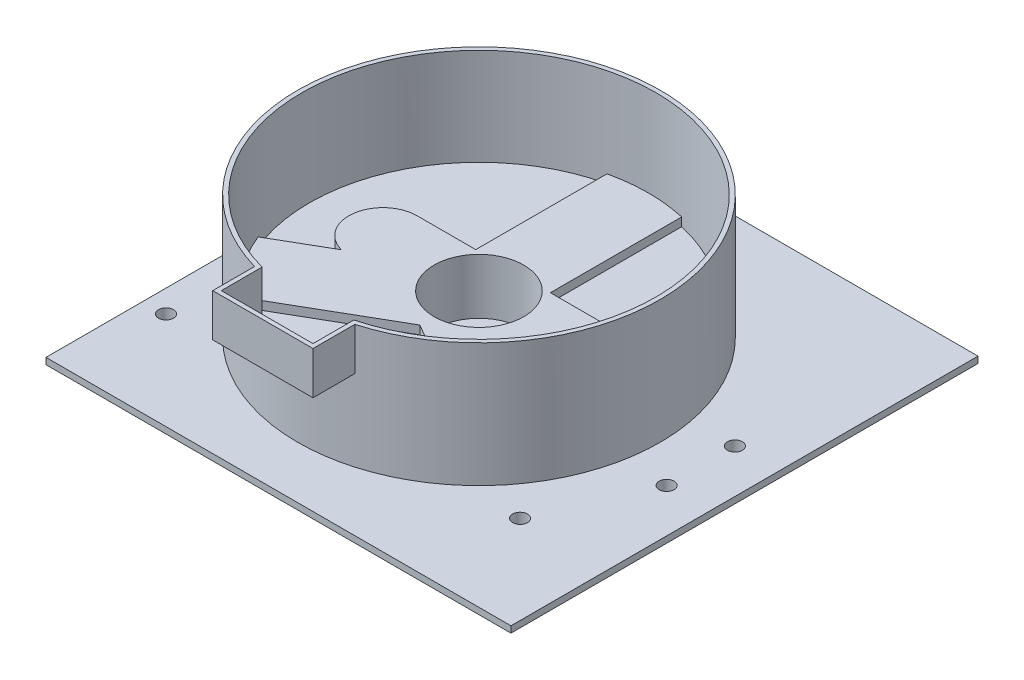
ISO-10303-21;
HEADER;
FILE_DESCRIPTION(('STEP AP214'),'2;1');
FILE_NAME('part.step','',(''),(''),'','','');
FILE_SCHEMA(('AUTOMOTIVE_DESIGN { 1 0 10303 214 1 1 1 1 }'));
ENDSEC;
DATA;
#1=APPLICATION_CONTEXT('core data for automotive mechanical design processes');
#2=APPLICATION_PROTOCOL_DEFINITION('international standard','automotive_design',2000,#1);
#3=PRODUCT_CONTEXT('',#1,'mechanical');
#4=PRODUCT('Part','Part','',(#3));
#5=PRODUCT_RELATED_PRODUCT_CATEGORY('part','',(#4));
#6=PRODUCT_DEFINITION_FORMATION('','',#4);
#7=PRODUCT_DEFINITION_CONTEXT('part definition',#1,'design');
#8=PRODUCT_DEFINITION('design','',#6,#7);
#9=PRODUCT_DEFINITION_SHAPE('','',#8);
#10=(LENGTH_UNIT() NAMED_UNIT(*) SI_UNIT(.MILLI.,.METRE.));
#11=(NAMED_UNIT(*) PLANE_ANGLE_UNIT() SI_UNIT($,.RADIAN.));
#12=(NAMED_UNIT(*) SI_UNIT($,.STERADIAN.) SOLID_ANGLE_UNIT());
#13=UNCERTAINTY_MEASURE_WITH_UNIT(LENGTH_MEASURE(1.E-05),#10,'distance_accuracy_value','');
#14=(GEOMETRIC_REPRESENTATION_CONTEXT(3) GLOBAL_UNCERTAINTY_ASSIGNED_CONTEXT((#13)) GLOBAL_UNIT_ASSIGNED_CONTEXT((#10,
#11,#12)) REPRESENTATION_CONTEXT('',''));
#15=CARTESIAN_POINT('',(0.,0.,0.));
#16=DIRECTION('',(0.,0.,1.));
#17=DIRECTION('',(1.,0.,0.));
#18=AXIS2_PLACEMENT_3D('',#15,#16,#17);
#19=CARTESIAN_POINT('',(47.25,0.,0.));
#20=DIRECTION('',(1.,0.,0.));
#21=DIRECTION('',(0.,0.,-1.));
#22=AXIS2_PLACEMENT_3D('',#19,#20,#21);
#23=PLANE('',#22);
#24=DIRECTION('',(0.,0.,-1.));
#25=VECTOR('',#24,1.);
#26=CARTESIAN_POINT('',(47.25,3.,50.));
#27=LINE('',#26,#25);
#28=CARTESIAN_POINT('',(47.25,3.,54.75));
#29=VERTEX_POINT('',#28);
#30=CARTESIAN_POINT('',(47.25,3.,50.));
#31=VERTEX_POINT('',#30);
#32=EDGE_CURVE('E628',#29,#31,#27,.T.);
#33=ORIENTED_EDGE('',*,*,#32,.F.);
#34=DIRECTION('',(0.,-1.,0.));
#35=VECTOR('',#34,1.);
#36=CARTESIAN_POINT('',(47.25,0.,54.75));
#37=LINE('',#36,#35);
#38=CARTESIAN_POINT('',(47.25,4.5,54.75));
#39=VERTEX_POINT('',#38);
#40=EDGE_CURVE('E627',#39,#29,#37,.T.);
#41=ORIENTED_EDGE('',*,*,#40,.F.);
#42=DIRECTION('',(0.,0.,-1.));
#43=VECTOR('',#42,1.);
#44=CARTESIAN_POINT('',(47.25,4.5,0.));
#45=LINE('',#44,#43);
#46=CARTESIAN_POINT('',(47.25,4.5,-54.75));
#47=VERTEX_POINT('',#46);
#48=EDGE_CURVE('E11',#39,#47,#45,.T.);
#49=ORIENTED_EDGE('',*,*,#48,.T.);
#50=DIRECTION('',(0.,1.,0.));
#51=VECTOR('',#50,1.);
#52=CARTESIAN_POINT('',(47.25,0.,-54.75));
#53=LINE('',#52,#51);
#54=CARTESIAN_POINT('',(47.25,3.,-54.75));
#55=VERTEX_POINT('',#54);
#56=EDGE_CURVE('E625',#55,#47,#53,.T.);
#57=ORIENTED_EDGE('',*,*,#56,.F.);
#58=CARTESIAN_POINT('',(47.25,3.,-50.));
#59=VERTEX_POINT('',#58);
#60=EDGE_CURVE('E630',#59,#55,#27,.T.);
#61=ORIENTED_EDGE('',*,*,#60,.F.);
#62=DIRECTION('',(0.,1.,0.));
#63=VECTOR('',#62,1.);
#64=CARTESIAN_POINT('',(47.25,3.,-50.));
#65=LINE('',#64,#63);
#66=CARTESIAN_POINT('',(47.25,0.,-50.));
#67=VERTEX_POINT('',#66);
#68=EDGE_CURVE('E632',#67,#59,#65,.T.);
#69=ORIENTED_EDGE('',*,*,#68,.F.);
#70=DIRECTION('',(0.,0.,-1.));
#71=VECTOR('',#70,1.);
#72=CARTESIAN_POINT('',(47.25,0.,0.));
#73=LINE('',#72,#71);
#74=CARTESIAN_POINT('',(47.25,0.,50.));
#75=VERTEX_POINT('',#74);
#76=EDGE_CURVE('E57',#75,#67,#73,.T.);
#77=ORIENTED_EDGE('',*,*,#76,.F.);
#78=DIRECTION('',(0.,-1.,0.));
#79=VECTOR('',#78,1.);
#80=CARTESIAN_POINT('',(47.25,3.,50.));
#81=LINE('',#80,#79);
#82=EDGE_CURVE('E45',#31,#75,#81,.T.);
#83=ORIENTED_EDGE('',*,*,#82,.F.);
#84=EDGE_LOOP('',(#33,#41,#49,#57,#61,#69,#77,#83));
#85=FACE_BOUND('',#84,.T.);
#86=ADVANCED_FACE('F42',(#85),#23,.F.);
#87=CARTESIAN_POINT('',(71.5,-62.0634601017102,0.));
#88=DIRECTION('',(0.,1.,0.));
#89=DIRECTION('',(0.,0.,1.));
#90=AXIS2_PLACEMENT_3D('',#87,#88,#89);
#91=CYLINDRICAL_SURFACE('',#90,7.99999999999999);
#92=CARTESIAN_POINT('',(71.5,12.,0.));
#93=DIRECTION('',(0.,-1.,0.));
#94=DIRECTION('',(0.,0.,1.));
#95=AXIS2_PLACEMENT_3D('',#92,#93,#94);
#96=CIRCLE('',#95,7.99999999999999);
#97=CARTESIAN_POINT('',(69.5629289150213,12.,7.76194277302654));
#98=VERTEX_POINT('',#97);
#99=CARTESIAN_POINT('',(71.5,12.,-8.00000000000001));
#100=VERTEX_POINT('',#99);
#101=EDGE_CURVE('E406',#98,#100,#96,.T.);
#102=ORIENTED_EDGE('',*,*,#101,.F.);
#103=DIRECTION('',(0.,1.,0.));
#104=VECTOR('',#103,1.);
#105=CARTESIAN_POINT('',(69.5629289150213,-62.0634601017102,7.76194277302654));
#106=LINE('',#105,#104);
#107=CARTESIAN_POINT('',(69.5629289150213,14.,7.76194277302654));
#108=VERTEX_POINT('',#107);
#109=EDGE_CURVE('E506',#108,#98,#106,.F.);
#110=ORIENTED_EDGE('',*,*,#109,.F.);
#111=CARTESIAN_POINT('',(71.5,14.,0.));
#112=DIRECTION('',(0.,-1.,0.));
#113=DIRECTION('',(0.,0.,1.));
#114=AXIS2_PLACEMENT_3D('',#111,#112,#113);
#115=CIRCLE('',#114,7.99999999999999);
#116=CARTESIAN_POINT('',(71.5,14.,-8.00000000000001));
#117=VERTEX_POINT('',#116);
#118=EDGE_CURVE('E459',#108,#117,#115,.T.);
#119=ORIENTED_EDGE('',*,*,#118,.T.);
#120=DIRECTION('',(0.,1.,0.));
#121=VECTOR('',#120,1.);
#122=CARTESIAN_POINT('',(71.5,-62.0634601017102,-8.00000000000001));
#123=LINE('',#122,#121);
#124=EDGE_CURVE('E496',#100,#117,#123,.T.);
#125=ORIENTED_EDGE('',*,*,#124,.F.);
#126=EDGE_LOOP('',(#102,#110,#119,#125));
#127=FACE_BOUND('',#126,.T.);
#128=ADVANCED_FACE('F680',(#127),#91,.T.);
#129=CARTESIAN_POINT('',(116.5,-62.0634601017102,-8.00000000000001));
#130=DIRECTION('',(0.,0.,-1.));
#131=DIRECTION('',(-1.,0.,0.));
#132=AXIS2_PLACEMENT_3D('',#129,#130,#131);
#133=PLANE('',#132);
#134=DIRECTION('',(1.,0.,0.));
#135=VECTOR('',#134,1.);
#136=CARTESIAN_POINT('',(71.5,12.,-8.00000000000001));
#137=LINE('',#136,#135);
#138=CARTESIAN_POINT('',(85.2499999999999,12.,-8.00000000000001));
#139=VERTEX_POINT('',#138);
#140=EDGE_CURVE('E403',#100,#139,#137,.T.);
#141=ORIENTED_EDGE('',*,*,#140,.F.);
#142=ORIENTED_EDGE('',*,*,#124,.T.);
#143=DIRECTION('',(1.,0.,0.));
#144=VECTOR('',#143,1.);
#145=CARTESIAN_POINT('',(85.2499999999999,14.,-8.00000000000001));
#146=LINE('',#145,#144);
#147=CARTESIAN_POINT('',(85.2499999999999,14.,-8.00000000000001));
#148=VERTEX_POINT('',#147);
#149=EDGE_CURVE('E462',#117,#148,#146,.T.);
#150=ORIENTED_EDGE('',*,*,#149,.T.);
#151=DIRECTION('',(0.,-1.,0.));
#152=VECTOR('',#151,1.);
#153=CARTESIAN_POINT('',(85.2499999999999,1.,-8.00000000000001));
#154=LINE('',#153,#152);
#155=EDGE_CURVE('E499',#148,#139,#154,.T.);
#156=ORIENTED_EDGE('',*,*,#155,.T.);
#157=EDGE_LOOP('',(#141,#142,#150,#156));
#158=FACE_BOUND('',#157,.T.);
#159=ADVANCED_FACE('F684',(#158),#133,.T.);
#160=DIRECTION('',(1.,0.,0.));
#161=VECTOR('',#160,1.);
#162=CARTESIAN_POINT('',(102.75,12.,-8.00000000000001));
#163=LINE('',#162,#161);
#164=CARTESIAN_POINT('',(102.75,12.,-8.00000000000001));
#165=VERTEX_POINT('',#164);
#166=CARTESIAN_POINT('',(116.5,12.,-8.00000000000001));
#167=VERTEX_POINT('',#166);
#168=EDGE_CURVE('E409',#165,#167,#163,.T.);
#169=ORIENTED_EDGE('',*,*,#168,.F.);
#170=DIRECTION('',(0.,-1.,0.));
#171=VECTOR('',#170,1.);
#172=CARTESIAN_POINT('',(102.75,1.,-8.00000000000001));
#173=LINE('',#172,#171);
#174=CARTESIAN_POINT('',(102.75,14.,-8.00000000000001));
#175=VERTEX_POINT('',#174);
#176=EDGE_CURVE('E503',#175,#165,#173,.T.);
#177=ORIENTED_EDGE('',*,*,#176,.F.);
#178=DIRECTION('',(1.,0.,0.));
#179=VECTOR('',#178,1.);
#180=CARTESIAN_POINT('',(116.5,14.,-8.00000000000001));
#181=LINE('',#180,#179);
#182=CARTESIAN_POINT('',(116.5,14.,-8.00000000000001));
#183=VERTEX_POINT('',#182);
#184=EDGE_CURVE('E486',#175,#183,#181,.T.);
#185=ORIENTED_EDGE('',*,*,#184,.T.);
#186=DIRECTION('',(0.,1.,0.));
#187=VECTOR('',#186,1.);
#188=CARTESIAN_POINT('',(116.5,-62.0634601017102,-8.00000000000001));
#189=LINE('',#188,#187);
#190=EDGE_CURVE('E497',#167,#183,#189,.T.);
#191=ORIENTED_EDGE('',*,*,#190,.F.);
#192=EDGE_LOOP('',(#169,#177,#185,#191));
#193=FACE_BOUND('',#192,.T.);
#194=ADVANCED_FACE('F782',(#193),#133,.T.);
#195=CARTESIAN_POINT('',(116.5,-62.0634601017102,0.));
#196=DIRECTION('',(0.,1.,0.));
#197=DIRECTION('',(0.,0.,1.));
#198=AXIS2_PLACEMENT_3D('',#195,#196,#197);
#199=CYLINDRICAL_SURFACE('',#198,7.99999999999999);
#200=CARTESIAN_POINT('',(116.5,12.,0.));
#201=DIRECTION('',(0.,-1.,0.));
#202=DIRECTION('',(0.,0.,1.));
#203=AXIS2_PLACEMENT_3D('',#200,#201,#202);
#204=CIRCLE('',#203,7.99999999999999);
#205=CARTESIAN_POINT('',(118.437071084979,12.,7.76194277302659));
#206=VERTEX_POINT('',#205);
#207=EDGE_CURVE('E421',#167,#206,#204,.T.);
#208=ORIENTED_EDGE('',*,*,#207,.F.);
#209=ORIENTED_EDGE('',*,*,#190,.T.);
#210=CARTESIAN_POINT('',(116.5,14.,0.));
#211=DIRECTION('',(0.,-1.,0.));
#212=DIRECTION('',(0.,0.,1.));
#213=AXIS2_PLACEMENT_3D('',#210,#211,#212);
#214=CIRCLE('',#213,8.);
#215=CARTESIAN_POINT('',(118.437071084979,14.,7.76194277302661));
#216=VERTEX_POINT('',#215);
#217=EDGE_CURVE('E477',#183,#216,#214,.T.);
#218=ORIENTED_EDGE('',*,*,#217,.T.);
#219=DIRECTION('',(0.,1.,0.));
#220=VECTOR('',#219,1.);
#221=CARTESIAN_POINT('',(118.437071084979,-62.0634601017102,7.76194277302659));
#222=LINE('',#221,#220);
#223=EDGE_CURVE('E509',#216,#206,#222,.F.);
#224=ORIENTED_EDGE('',*,*,#223,.T.);
#225=EDGE_LOOP('',(#208,#209,#218,#224));
#226=FACE_BOUND('',#225,.T.);
#227=ADVANCED_FACE('F774',(#226),#199,.T.);
#228=CARTESIAN_POINT('',(26.2482479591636,1.,-45.4632990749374));
#229=DIRECTION('',(0.5,0.,-0.866025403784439));
#230=DIRECTION('',(-0.866025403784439,0.,-0.5));
#231=AXIS2_PLACEMENT_3D('',#228,#229,#230);
#232=PLANE('',#231);
#233=DIRECTION('',(0.866025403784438,0.,0.5));
#234=VECTOR('',#233,1.);
#235=CARTESIAN_POINT('',(118.437071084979,12.,7.7619427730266));
#236=LINE('',#235,#234);
#237=CARTESIAN_POINT('',(130.84206373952,12.,14.9239686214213));
#238=VERTEX_POINT('',#237);
#239=EDGE_CURVE('E418',#206,#238,#236,.T.);
#240=ORIENTED_EDGE('',*,*,#239,.F.);
#241=ORIENTED_EDGE('',*,*,#223,.F.);
#242=DIRECTION('',(0.866025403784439,0.,0.5));
#243=VECTOR('',#242,1.);
#244=CARTESIAN_POINT('',(130.84206373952,14.,14.9239686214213));
#245=LINE('',#244,#243);
#246=CARTESIAN_POINT('',(130.84206373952,14.,14.9239686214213));
#247=VERTEX_POINT('',#246);
#248=EDGE_CURVE('E480',#216,#247,#245,.T.);
#249=ORIENTED_EDGE('',*,*,#248,.T.);
#250=DIRECTION('',(0.,1.,0.));
#251=VECTOR('',#250,1.);
#252=CARTESIAN_POINT('',(130.84206373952,1.,14.9239686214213));
#253=LINE('',#252,#251);
#254=EDGE_CURVE('E587',#238,#247,#253,.T.);
#255=ORIENTED_EDGE('',*,*,#254,.F.);
#256=EDGE_LOOP('',(#240,#241,#249,#255));
#257=FACE_BOUND('',#256,.T.);
#258=ADVANCED_FACE('F771',(#257),#232,.T.);
#259=CARTESIAN_POINT('',(116.5,12.,0.));
#260=DIRECTION('',(0.,1.,0.));
#261=DIRECTION('',(0.,0.,1.));
#262=AXIS2_PLACEMENT_3D('',#259,#260,#261);
#263=PLANE('',#262);
#264=ORIENTED_EDGE('',*,*,#207,.T.);
#265=ORIENTED_EDGE('',*,*,#239,.T.);
#266=CARTESIAN_POINT('',(93.9999999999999,12.,0.));
#267=DIRECTION('',(0.,1.,0.));
#268=DIRECTION('',(0.,0.,1.));
#269=AXIS2_PLACEMENT_3D('',#266,#267,#268);
#270=CIRCLE('',#269,39.75);
#271=CARTESIAN_POINT('',(102.75,12.,-38.7749919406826));
#272=VERTEX_POINT('',#271);
#273=EDGE_CURVE('E415',#238,#272,#270,.T.);
#274=ORIENTED_EDGE('',*,*,#273,.T.);
#275=DIRECTION('',(0.,0.,1.));
#276=VECTOR('',#275,1.);
#277=CARTESIAN_POINT('',(102.75,12.,-38.7749919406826));
#278=LINE('',#277,#276);
#279=EDGE_CURVE('E412',#272,#165,#278,.T.);
#280=ORIENTED_EDGE('',*,*,#279,.T.);
#281=ORIENTED_EDGE('',*,*,#168,.T.);
#282=EDGE_LOOP('',(#264,#265,#274,#280,#281));
#283=FACE_BOUND('',#282,.T.);
#284=ADVANCED_FACE('F773',(#283),#263,.T.);
#285=CARTESIAN_POINT('',(102.75,1.,0.));
#286=DIRECTION('',(-1.,0.,0.));
#287=DIRECTION('',(0.,0.,1.));
#288=AXIS2_PLACEMENT_3D('',#285,#286,#287);
#289=PLANE('',#288);
#290=ORIENTED_EDGE('',*,*,#176,.T.);
#291=ORIENTED_EDGE('',*,*,#279,.F.);
#292=DIRECTION('',(0.,1.,0.));
#293=VECTOR('',#292,1.);
#294=CARTESIAN_POINT('',(102.75,1.,-38.7749919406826));
#295=LINE('',#294,#293);
#296=CARTESIAN_POINT('',(102.75,14.,-38.7749919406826));
#297=VERTEX_POINT('',#296);
#298=EDGE_CURVE('E582',#272,#297,#295,.T.);
#299=ORIENTED_EDGE('',*,*,#298,.T.);
#300=DIRECTION('',(0.,0.,1.));
#301=VECTOR('',#300,1.);
#302=CARTESIAN_POINT('',(102.75,14.,-38.7749919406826));
#303=LINE('',#302,#301);
#304=EDGE_CURVE('E483',#297,#175,#303,.T.);
#305=ORIENTED_EDGE('',*,*,#304,.T.);
#306=EDGE_LOOP('',(#290,#291,#299,#305));
#307=FACE_BOUND('',#306,.T.);
#308=ADVANCED_FACE('F708',(#307),#289,.F.);
#309=CARTESIAN_POINT('',(85.2499999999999,1.,0.));
#310=DIRECTION('',(-1.,0.,0.));
#311=DIRECTION('',(0.,0.,1.));
#312=AXIS2_PLACEMENT_3D('',#309,#310,#311);
#313=PLANE('',#312);
#314=DIRECTION('',(0.,0.,-1.));
#315=VECTOR('',#314,1.);
#316=CARTESIAN_POINT('',(85.2499999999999,12.,-8.00000000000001));
#317=LINE('',#316,#315);
#318=CARTESIAN_POINT('',(85.2499999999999,12.,-38.7749919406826));
#319=VERTEX_POINT('',#318);
#320=EDGE_CURVE('E400',#139,#319,#317,.T.);
#321=ORIENTED_EDGE('',*,*,#320,.F.);
#322=ORIENTED_EDGE('',*,*,#155,.F.);
#323=DIRECTION('',(0.,0.,-1.));
#324=VECTOR('',#323,1.);
#325=CARTESIAN_POINT('',(85.2499999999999,14.,-38.7749919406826));
#326=LINE('',#325,#324);
#327=CARTESIAN_POINT('',(85.2499999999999,14.,-38.7749919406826));
#328=VERTEX_POINT('',#327);
#329=EDGE_CURVE('E465',#148,#328,#326,.T.);
#330=ORIENTED_EDGE('',*,*,#329,.T.);
#331=DIRECTION('',(0.,1.,0.));
#332=VECTOR('',#331,1.);
#333=CARTESIAN_POINT('',(85.2499999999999,1.,-38.7749919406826));
#334=LINE('',#333,#332);
#335=EDGE_CURVE('E575',#319,#328,#334,.T.);
#336=ORIENTED_EDGE('',*,*,#335,.F.);
#337=EDGE_LOOP('',(#321,#322,#330,#336));
#338=FACE_BOUND('',#337,.T.);
#339=ADVANCED_FACE('F753',(#338),#313,.T.);
#340=CARTESIAN_POINT('',(71.5,12.,0.));
#341=DIRECTION('',(0.,1.,0.));
#342=DIRECTION('',(0.,0.,1.));
#343=AXIS2_PLACEMENT_3D('',#340,#341,#342);
#344=PLANE('',#343);
#345=ORIENTED_EDGE('',*,*,#101,.T.);
#346=ORIENTED_EDGE('',*,*,#140,.T.);
#347=ORIENTED_EDGE('',*,*,#320,.T.);
#348=CARTESIAN_POINT('',(93.9999999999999,12.,0.));
#349=DIRECTION('',(0.,1.,0.));
#350=DIRECTION('',(0.,0.,1.));
#351=AXIS2_PLACEMENT_3D('',#348,#349,#350);
#352=CIRCLE('',#351,39.75);
#353=CARTESIAN_POINT('',(57.1579362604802,12.,14.9239686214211));
#354=VERTEX_POINT('',#353);
#355=EDGE_CURVE('E397',#319,#354,#352,.T.);
#356=ORIENTED_EDGE('',*,*,#355,.T.);
#357=DIRECTION('',(0.86602540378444,0.,-0.499999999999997));
#358=VECTOR('',#357,1.);
#359=CARTESIAN_POINT('',(57.1579362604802,12.,14.9239686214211));
#360=LINE('',#359,#358);
#361=EDGE_CURVE('E394',#354,#98,#360,.T.);
#362=ORIENTED_EDGE('',*,*,#361,.T.);
#363=EDGE_LOOP('',(#345,#346,#347,#356,#362));
#364=FACE_BOUND('',#363,.T.);
#365=ADVANCED_FACE('F756',(#364),#344,.T.);
#366=CARTESIAN_POINT('',(20.7517520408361,1.,35.9430888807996));
#367=DIRECTION('',(0.499999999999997,0.,0.86602540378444));
#368=DIRECTION('',(0.86602540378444,0.,-0.499999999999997));
#369=AXIS2_PLACEMENT_3D('',#366,#367,#368);
#370=PLANE('',#369);
#371=ORIENTED_EDGE('',*,*,#109,.T.);
#372=ORIENTED_EDGE('',*,*,#361,.F.);
#373=DIRECTION('',(0.,1.,0.));
#374=VECTOR('',#373,1.);
#375=CARTESIAN_POINT('',(57.1579362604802,1.,14.9239686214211));
#376=LINE('',#375,#374);
#377=CARTESIAN_POINT('',(57.1579362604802,14.,14.9239686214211));
#378=VERTEX_POINT('',#377);
#379=EDGE_CURVE('E574',#354,#378,#376,.T.);
#380=ORIENTED_EDGE('',*,*,#379,.T.);
#381=DIRECTION('',(0.86602540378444,0.,-0.499999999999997));
#382=VECTOR('',#381,1.);
#383=CARTESIAN_POINT('',(57.1579362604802,14.,14.9239686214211));
#384=LINE('',#383,#382);
#385=EDGE_CURVE('E456',#378,#108,#384,.T.);
#386=ORIENTED_EDGE('',*,*,#385,.T.);
#387=EDGE_LOOP('',(#371,#372,#380,#386));
#388=FACE_BOUND('',#387,.T.);
#389=ADVANCED_FACE('F758',(#388),#370,.F.);
#390=CARTESIAN_POINT('',(0.,14.,0.));
#391=DIRECTION('',(0.,1.,0.));
#392=DIRECTION('',(0.,0.,1.));
#393=AXIS2_PLACEMENT_3D('',#390,#391,#392);
#394=PLANE('',#393);
#395=CARTESIAN_POINT('',(93.9999999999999,14.,0.));
#396=DIRECTION('',(0.,1.,0.));
#397=DIRECTION('',(0.,0.,1.));
#398=AXIS2_PLACEMENT_3D('',#395,#396,#397);
#399=CIRCLE('',#398,10.5);
#400=CARTESIAN_POINT('',(93.9999999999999,14.,10.5));
#401=VERTEX_POINT('',#400);
#402=EDGE_CURVE('E474',#401,#401,#399,.T.);
#403=ORIENTED_EDGE('',*,*,#402,.F.);
#404=EDGE_LOOP('',(#403));
#405=FACE_BOUND('',#404,.T.);
#406=DIRECTION('',(-0.866025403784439,0.,-0.5));
#407=VECTOR('',#406,1.);
#408=CARTESIAN_POINT('',(120.81567918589,14.,29.3424922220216));
#409=LINE('',#408,#407);
#410=CARTESIAN_POINT('',(120.81567918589,14.,29.3424922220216));
#411=VERTEX_POINT('',#410);
#412=CARTESIAN_POINT('',(93.9999999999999,14.,13.8604526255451));
#413=VERTEX_POINT('',#412);
#414=EDGE_CURVE('E468',#411,#413,#409,.T.);
#415=ORIENTED_EDGE('',*,*,#414,.F.);
#416=CARTESIAN_POINT('',(93.9999999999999,14.,0.));
#417=DIRECTION('',(0.,1.,0.));
#418=DIRECTION('',(0.,0.,-1.));
#419=AXIS2_PLACEMENT_3D('',#416,#417,#418);
#420=CIRCLE('',#419,39.75);
#421=EDGE_CURVE('E389',#411,#247,#420,.T.);
#422=ORIENTED_EDGE('',*,*,#421,.T.);
#423=ORIENTED_EDGE('',*,*,#248,.F.);
#424=ORIENTED_EDGE('',*,*,#217,.F.);
#425=ORIENTED_EDGE('',*,*,#184,.F.);
#426=ORIENTED_EDGE('',*,*,#304,.F.);
#427=EDGE_CURVE('E382',#297,#328,#420,.T.);
#428=ORIENTED_EDGE('',*,*,#427,.T.);
#429=ORIENTED_EDGE('',*,*,#329,.F.);
#430=ORIENTED_EDGE('',*,*,#149,.F.);
#431=ORIENTED_EDGE('',*,*,#118,.F.);
#432=ORIENTED_EDGE('',*,*,#385,.F.);
#433=CARTESIAN_POINT('',(67.1843208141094,14.,29.3424922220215));
#434=VERTEX_POINT('',#433);
#435=EDGE_CURVE('E390',#378,#434,#420,.T.);
#436=ORIENTED_EDGE('',*,*,#435,.T.);
#437=DIRECTION('',(-0.86602540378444,0.,0.499999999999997));
#438=VECTOR('',#437,1.);
#439=CARTESIAN_POINT('',(67.1843208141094,14.,29.3424922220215));
#440=LINE('',#439,#438);
#441=EDGE_CURVE('E471',#413,#434,#440,.T.);
#442=ORIENTED_EDGE('',*,*,#441,.F.);
#443=EDGE_LOOP('',(#415,#422,#423,#424,#425,#426,#428,#429,#430,#431,#432,#436,#442));
#444=FACE_BOUND('',#443,.T.);
#445=ADVANCED_FACE('F761',(#405,#444),#394,.T.);
#446=CARTESIAN_POINT('',(0.,4.5,0.));
#447=DIRECTION('',(0.,1.,0.));
#448=DIRECTION('',(0.,0.,1.));
#449=AXIS2_PLACEMENT_3D('',#446,#447,#448);
#450=PLANE('',#449);
#451=CARTESIAN_POINT('',(93.9999999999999,4.5,0.));
#452=DIRECTION('',(0.,1.,0.));
#453=DIRECTION('',(0.,0.,1.));
#454=AXIS2_PLACEMENT_3D('',#451,#452,#453);
#455=CIRCLE('',#454,39.75);
#456=CARTESIAN_POINT('',(93.9999999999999,4.5,39.75));
#457=VERTEX_POINT('',#456);
#458=EDGE_CURVE('E391',#457,#457,#455,.F.);
#459=ORIENTED_EDGE('',*,*,#458,.T.);
#460=EDGE_LOOP('',(#459));
#461=FACE_BOUND('',#460,.T.);
#462=CARTESIAN_POINT('',(93.9999999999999,4.5,0.));
#463=DIRECTION('',(0.,1.,0.));
#464=DIRECTION('',(0.,0.,1.));
#465=AXIS2_PLACEMENT_3D('',#462,#463,#464);
#466=CIRCLE('',#465,41.5);
#467=CARTESIAN_POINT('',(93.9999999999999,4.5,41.5));
#468=VERTEX_POINT('',#467);
#469=EDGE_CURVE('E523',#468,#468,#466,.F.);
#470=ORIENTED_EDGE('',*,*,#469,.F.);
#471=EDGE_LOOP('',(#470));
#472=FACE_BOUND('',#471,.T.);
#473=ADVANCED_FACE('F706',(#461,#472),#450,.T.);
#474=CARTESIAN_POINT('',(29.5017520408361,1.,51.0985334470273));
#475=DIRECTION('',(0.499999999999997,0.,0.86602540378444));
#476=DIRECTION('',(0.86602540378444,0.,-0.499999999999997));
#477=AXIS2_PLACEMENT_3D('',#474,#475,#476);
#478=PLANE('',#477);
#479=DIRECTION('',(-0.86602540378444,0.,0.499999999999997));
#480=VECTOR('',#479,1.);
#481=CARTESIAN_POINT('',(67.1843208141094,12.,29.3424922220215));
#482=LINE('',#481,#480);
#483=CARTESIAN_POINT('',(93.9999999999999,12.,13.8604526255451));
#484=VERTEX_POINT('',#483);
#485=CARTESIAN_POINT('',(67.1843208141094,12.,29.3424922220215));
#486=VERTEX_POINT('',#485);
#487=EDGE_CURVE('E453',#484,#486,#482,.T.);
#488=ORIENTED_EDGE('',*,*,#487,.F.);
#489=DIRECTION('',(0.,1.,0.));
#490=VECTOR('',#489,1.);
#491=CARTESIAN_POINT('',(93.9999999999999,1.,13.8604526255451));
#492=LINE('',#491,#490);
#493=EDGE_CURVE('E583',#484,#413,#492,.T.);
#494=ORIENTED_EDGE('',*,*,#493,.T.);
#495=ORIENTED_EDGE('',*,*,#441,.T.);
#496=DIRECTION('',(0.,1.,0.));
#497=VECTOR('',#496,1.);
#498=CARTESIAN_POINT('',(67.1843208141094,1.,29.3424922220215));
#499=LINE('',#498,#497);
#500=EDGE_CURVE('E580',#486,#434,#499,.T.);
#501=ORIENTED_EDGE('',*,*,#500,.F.);
#502=EDGE_LOOP('',(#488,#494,#495,#501));
#503=FACE_BOUND('',#502,.T.);
#504=ADVANCED_FACE('F763',(#503),#478,.T.);
#505=CARTESIAN_POINT('',(17.4982479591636,1.,-30.3078545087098));
#506=DIRECTION('',(0.5,0.,-0.866025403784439));
#507=DIRECTION('',(-0.866025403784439,0.,-0.5));
#508=AXIS2_PLACEMENT_3D('',#505,#506,#507);
#509=PLANE('',#508);
#510=ORIENTED_EDGE('',*,*,#493,.F.);
#511=DIRECTION('',(-0.866025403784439,0.,-0.5));
#512=VECTOR('',#511,1.);
#513=CARTESIAN_POINT('',(120.81567918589,12.,29.3424922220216));
#514=LINE('',#513,#512);
#515=CARTESIAN_POINT('',(120.81567918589,12.,29.3424922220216));
#516=VERTEX_POINT('',#515);
#517=EDGE_CURVE('E451',#516,#484,#514,.T.);
#518=ORIENTED_EDGE('',*,*,#517,.F.);
#519=DIRECTION('',(0.,1.,0.));
#520=VECTOR('',#519,1.);
#521=CARTESIAN_POINT('',(120.81567918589,1.,29.3424922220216));
#522=LINE('',#521,#520);
#523=EDGE_CURVE('E577',#516,#411,#522,.T.);
#524=ORIENTED_EDGE('',*,*,#523,.T.);
#525=ORIENTED_EDGE('',*,*,#414,.T.);
#526=EDGE_LOOP('',(#510,#518,#524,#525));
#527=FACE_BOUND('',#526,.T.);
#528=ADVANCED_FACE('F766',(#527),#509,.F.);
#529=CARTESIAN_POINT('',(93.9999999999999,-309.533437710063,0.));
#530=DIRECTION('',(0.,1.,0.));
#531=DIRECTION('',(0.,0.,1.));
#532=AXIS2_PLACEMENT_3D('',#529,#530,#531);
#533=CYLINDRICAL_SURFACE('',#532,39.75);
#534=ORIENTED_EDGE('',*,*,#458,.F.);
#535=EDGE_LOOP('',(#534));
#536=FACE_BOUND('',#535,.T.);
#537=ORIENTED_EDGE('',*,*,#435,.F.);
#538=ORIENTED_EDGE('',*,*,#379,.F.);
#539=ORIENTED_EDGE('',*,*,#355,.F.);
#540=ORIENTED_EDGE('',*,*,#335,.T.);
#541=ORIENTED_EDGE('',*,*,#427,.F.);
#542=ORIENTED_EDGE('',*,*,#298,.F.);
#543=ORIENTED_EDGE('',*,*,#273,.F.);
#544=ORIENTED_EDGE('',*,*,#254,.T.);
#545=ORIENTED_EDGE('',*,*,#421,.F.);
#546=ORIENTED_EDGE('',*,*,#523,.F.);
#547=CARTESIAN_POINT('',(93.9999999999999,12.,0.));
#548=DIRECTION('',(0.,1.,0.));
#549=DIRECTION('',(0.,0.,1.));
#550=AXIS2_PLACEMENT_3D('',#547,#548,#549);
#551=CIRCLE('',#550,39.75);
#552=EDGE_CURVE('E448',#486,#516,#551,.T.);
#553=ORIENTED_EDGE('',*,*,#552,.F.);
#554=ORIENTED_EDGE('',*,*,#500,.T.);
#555=EDGE_LOOP('',(#537,#538,#539,#540,#541,#542,#543,#544,#545,#546,#553,#554));
#556=FACE_BOUND('',#555,.T.);
#557=ADVANCED_FACE('F769',(#536,#556),#533,.T.);
#558=CARTESIAN_POINT('',(93.9999999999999,-28.698484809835,0.));
#559=DIRECTION('',(0.,1.,0.));
#560=DIRECTION('',(0.,0.,1.));
#561=AXIS2_PLACEMENT_3D('',#558,#559,#560);
#562=CYLINDRICAL_SURFACE('',#561,10.5);
#563=CARTESIAN_POINT('',(93.9999999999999,1.,0.));
#564=DIRECTION('',(0.,1.,0.));
#565=DIRECTION('',(0.,0.,1.));
#566=AXIS2_PLACEMENT_3D('',#563,#564,#565);
#567=CIRCLE('',#566,10.5);
#568=CARTESIAN_POINT('',(93.9999999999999,1.,10.5));
#569=VERTEX_POINT('',#568);
#570=EDGE_CURVE('E493',#569,#569,#567,.F.);
#571=ORIENTED_EDGE('',*,*,#570,.T.);
#572=EDGE_LOOP('',(#571));
#573=FACE_BOUND('',#572,.T.);
#574=ORIENTED_EDGE('',*,*,#402,.T.);
#575=EDGE_LOOP('',(#574));
#576=FACE_BOUND('',#575,.T.);
#577=ADVANCED_FACE('F847',(#573,#576),#562,.F.);
#578=CARTESIAN_POINT('',(93.9999999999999,23.5,0.));
#579=DIRECTION('',(0.,-1.,0.));
#580=DIRECTION('',(0.,0.,-1.));
#581=AXIS2_PLACEMENT_3D('',#578,#579,#580);
#582=CYLINDRICAL_SURFACE('',#581,41.5);
#583=CARTESIAN_POINT('',(93.9999999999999,23.5,0.));
#584=DIRECTION('',(0.,1.,0.));
#585=DIRECTION('',(1.,0.,0.));
#586=AXIS2_PLACEMENT_3D('',#583,#584,#585);
#587=CIRCLE('',#586,41.5);
#588=CARTESIAN_POINT('',(83.2500000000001,23.5,40.0835065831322));
#589=VERTEX_POINT('',#588);
#590=CARTESIAN_POINT('',(104.75,23.5,40.0835065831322));
#591=VERTEX_POINT('',#590);
#592=EDGE_CURVE('E375',#589,#591,#587,.T.);
#593=ORIENTED_EDGE('',*,*,#592,.T.);
#594=DIRECTION('',(0.,-1.,0.));
#595=VECTOR('',#594,1.);
#596=CARTESIAN_POINT('',(104.75,33.5,40.0835065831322));
#597=LINE('',#596,#595);
#598=CARTESIAN_POINT('',(104.75,33.5,40.0835065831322));
#599=VERTEX_POINT('',#598);
#600=EDGE_CURVE('E297',#599,#591,#597,.T.);
#601=ORIENTED_EDGE('',*,*,#600,.F.);
#602=CARTESIAN_POINT('',(94.0000000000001,33.5,0.));
#603=DIRECTION('',(0.,1.,0.));
#604=DIRECTION('',(0.,0.,1.));
#605=AXIS2_PLACEMENT_3D('',#602,#603,#604);
#606=CIRCLE('',#605,41.5);
#607=CARTESIAN_POINT('',(83.2500000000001,33.5,40.0835065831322));
#608=VERTEX_POINT('',#607);
#609=EDGE_CURVE('E333',#608,#599,#606,.F.);
#610=ORIENTED_EDGE('',*,*,#609,.F.);
#611=DIRECTION('',(0.,-1.,0.));
#612=VECTOR('',#611,1.);
#613=CARTESIAN_POINT('',(83.2500000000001,33.5,40.0835065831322));
#614=LINE('',#613,#612);
#615=EDGE_CURVE('E351',#608,#589,#614,.T.);
#616=ORIENTED_EDGE('',*,*,#615,.T.);
#617=EDGE_LOOP('',(#593,#601,#610,#616));
#618=FACE_BOUND('',#617,.T.);
#619=ORIENTED_EDGE('',*,*,#469,.T.);
#620=EDGE_LOOP('',(#619));
#621=FACE_BOUND('',#620,.T.);
#622=ADVANCED_FACE('F849',(#618,#621),#582,.F.);
#623=CARTESIAN_POINT('',(188.,33.5,49.6579705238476));
#624=DIRECTION('',(0.,0.,-1.));
#625=DIRECTION('',(-1.,0.,0.));
#626=AXIS2_PLACEMENT_3D('',#623,#624,#625);
#627=PLANE('',#626);
#628=DIRECTION('',(1.,0.,0.));
#629=VECTOR('',#628,1.);
#630=CARTESIAN_POINT('',(188.,23.5,49.6579705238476));
#631=LINE('',#630,#629);
#632=CARTESIAN_POINT('',(83.2500000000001,23.5,49.6579705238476));
#633=VERTEX_POINT('',#632);
#634=CARTESIAN_POINT('',(104.75,23.5,49.6579705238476));
#635=VERTEX_POINT('',#634);
#636=EDGE_CURVE('E318',#633,#635,#631,.T.);
#637=ORIENTED_EDGE('',*,*,#636,.F.);
#638=DIRECTION('',(0.,-1.,0.));
#639=VECTOR('',#638,1.);
#640=CARTESIAN_POINT('',(83.2500000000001,33.5,49.6579705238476));
#641=LINE('',#640,#639);
#642=CARTESIAN_POINT('',(83.2500000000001,33.5,49.6579705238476));
#643=VERTEX_POINT('',#642);
#644=EDGE_CURVE('E354',#643,#633,#641,.T.);
#645=ORIENTED_EDGE('',*,*,#644,.F.);
#646=DIRECTION('',(1.,0.,0.));
#647=VECTOR('',#646,1.);
#648=CARTESIAN_POINT('',(188.,33.5,49.6579705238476));
#649=LINE('',#648,#647);
#650=CARTESIAN_POINT('',(104.75,33.5,49.6579705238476));
#651=VERTEX_POINT('',#650);
#652=EDGE_CURVE('E327',#643,#651,#649,.T.);
#653=ORIENTED_EDGE('',*,*,#652,.T.);
#654=DIRECTION('',(0.,-1.,0.));
#655=VECTOR('',#654,1.);
#656=CARTESIAN_POINT('',(104.75,33.5,49.6579705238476));
#657=LINE('',#656,#655);
#658=EDGE_CURVE('E356',#651,#635,#657,.T.);
#659=ORIENTED_EDGE('',*,*,#658,.T.);
#660=EDGE_LOOP('',(#637,#645,#653,#659));
#661=FACE_BOUND('',#660,.T.);
#662=ADVANCED_FACE('F879',(#661),#627,.T.);
#663=CARTESIAN_POINT('',(83.2500000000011,33.5,-2.81053445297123E-12));
#664=DIRECTION('',(-1.,0.,0.));
#665=DIRECTION('',(0.,0.,1.));
#666=AXIS2_PLACEMENT_3D('',#663,#664,#665);
#667=PLANE('',#666);
#668=DIRECTION('',(0.,0.,-1.));
#669=VECTOR('',#668,1.);
#670=CARTESIAN_POINT('',(83.2500000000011,23.5,-2.81053445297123E-12));
#671=LINE('',#670,#669);
#672=CARTESIAN_POINT('',(83.25,23.5,41.1179705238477));
#673=VERTEX_POINT('',#672);
#674=EDGE_CURVE('E315',#633,#673,#671,.T.);
#675=ORIENTED_EDGE('',*,*,#674,.T.);
#676=EDGE_CURVE('E320',#673,#589,#671,.T.);
#677=ORIENTED_EDGE('',*,*,#676,.T.);
#678=ORIENTED_EDGE('',*,*,#615,.F.);
#679=DIRECTION('',(0.,0.,-1.));
#680=VECTOR('',#679,1.);
#681=CARTESIAN_POINT('',(83.2500000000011,33.5,-2.81053445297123E-12));
#682=LINE('',#681,#680);
#683=EDGE_CURVE('E330',#643,#608,#682,.T.);
#684=ORIENTED_EDGE('',*,*,#683,.F.);
#685=ORIENTED_EDGE('',*,*,#644,.T.);
#686=EDGE_LOOP('',(#675,#677,#678,#684,#685));
#687=FACE_BOUND('',#686,.T.);
#688=ADVANCED_FACE('F897',(#687),#667,.F.);
#689=CARTESIAN_POINT('',(188.,33.5,50.6579705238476));
#690=DIRECTION('',(0.,0.,-1.));
#691=DIRECTION('',(-1.,0.,0.));
#692=AXIS2_PLACEMENT_3D('',#689,#690,#691);
#693=PLANE('',#692);
#694=DIRECTION('',(1.,0.,0.));
#695=VECTOR('',#694,1.);
#696=CARTESIAN_POINT('',(188.,23.5,50.6579705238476));
#697=LINE('',#696,#695);
#698=CARTESIAN_POINT('',(82.2500000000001,23.5,50.6579705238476));
#699=VERTEX_POINT('',#698);
#700=CARTESIAN_POINT('',(105.75,23.5,50.6579705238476));
#701=VERTEX_POINT('',#700);
#702=EDGE_CURVE('E340',#699,#701,#697,.T.);
#703=ORIENTED_EDGE('',*,*,#702,.T.);
#704=DIRECTION('',(0.,-1.,0.));
#705=VECTOR('',#704,1.);
#706=CARTESIAN_POINT('',(105.75,33.5,50.6579705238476));
#707=LINE('',#706,#705);
#708=CARTESIAN_POINT('',(105.75,33.5,50.6579705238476));
#709=VERTEX_POINT('',#708);
#710=EDGE_CURVE('E335',#709,#701,#707,.T.);
#711=ORIENTED_EDGE('',*,*,#710,.F.);
#712=DIRECTION('',(1.,0.,0.));
#713=VECTOR('',#712,1.);
#714=CARTESIAN_POINT('',(188.,33.5,50.6579705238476));
#715=LINE('',#714,#713);
#716=CARTESIAN_POINT('',(82.2500000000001,33.5,50.6579705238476));
#717=VERTEX_POINT('',#716);
#718=EDGE_CURVE('E313',#717,#709,#715,.T.);
#719=ORIENTED_EDGE('',*,*,#718,.F.);
#720=DIRECTION('',(0.,-1.,0.));
#721=VECTOR('',#720,1.);
#722=CARTESIAN_POINT('',(82.2500000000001,33.5,50.6579705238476));
#723=LINE('',#722,#721);
#724=EDGE_CURVE('E360',#717,#699,#723,.T.);
#725=ORIENTED_EDGE('',*,*,#724,.T.);
#726=EDGE_LOOP('',(#703,#711,#719,#725));
#727=FACE_BOUND('',#726,.T.);
#728=ADVANCED_FACE('F836',(#727),#693,.F.);
#729=CARTESIAN_POINT('',(104.75,33.5,0.));
#730=DIRECTION('',(-1.,0.,0.));
#731=DIRECTION('',(0.,0.,1.));
#732=AXIS2_PLACEMENT_3D('',#729,#730,#731);
#733=PLANE('',#732);
#734=DIRECTION('',(0.,0.,-1.));
#735=VECTOR('',#734,1.);
#736=CARTESIAN_POINT('',(104.75,23.5,0.));
#737=LINE('',#736,#735);
#738=CARTESIAN_POINT('',(104.75,23.5,41.1179705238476));
#739=VERTEX_POINT('',#738);
#740=EDGE_CURVE('E343',#635,#739,#737,.T.);
#741=ORIENTED_EDGE('',*,*,#740,.F.);
#742=ORIENTED_EDGE('',*,*,#658,.F.);
#743=DIRECTION('',(0.,0.,-1.));
#744=VECTOR('',#743,1.);
#745=CARTESIAN_POINT('',(104.75,33.5,0.));
#746=LINE('',#745,#744);
#747=EDGE_CURVE('E324',#651,#599,#746,.T.);
#748=ORIENTED_EDGE('',*,*,#747,.T.);
#749=ORIENTED_EDGE('',*,*,#600,.T.);
#750=EDGE_CURVE('E346',#739,#591,#737,.T.);
#751=ORIENTED_EDGE('',*,*,#750,.F.);
#752=EDGE_LOOP('',(#741,#742,#748,#749,#751));
#753=FACE_BOUND('',#752,.T.);
#754=ADVANCED_FACE('F811',(#753),#733,.T.);
#755=CARTESIAN_POINT('',(93.9999999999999,12.,0.));
#756=DIRECTION('',(0.,1.,0.));
#757=DIRECTION('',(0.,0.,1.));
#758=AXIS2_PLACEMENT_3D('',#755,#756,#757);
#759=PLANE('',#758);
#760=ORIENTED_EDGE('',*,*,#552,.T.);
#761=ORIENTED_EDGE('',*,*,#517,.T.);
#762=ORIENTED_EDGE('',*,*,#487,.T.);
#763=EDGE_LOOP('',(#760,#761,#762));
#764=FACE_BOUND('',#763,.T.);
#765=DIRECTION('',(1.,0.,0.));
#766=VECTOR('',#765,1.);
#767=CARTESIAN_POINT('',(87.4999999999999,12.,37.3604526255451));
#768=LINE('',#767,#766);
#769=CARTESIAN_POINT('',(87.4999999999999,12.,37.3604526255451));
#770=VERTEX_POINT('',#769);
#771=CARTESIAN_POINT('',(100.5,12.,37.3604526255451));
#772=VERTEX_POINT('',#771);
#773=EDGE_CURVE('E427',#770,#772,#768,.T.);
#774=ORIENTED_EDGE('',*,*,#773,.F.);
#775=CARTESIAN_POINT('',(87.4999999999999,12.,35.3604526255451));
#776=DIRECTION('',(0.,1.,0.));
#777=DIRECTION('',(0.,0.,1.));
#778=AXIS2_PLACEMENT_3D('',#775,#776,#777);
#779=CIRCLE('',#778,2.);
#780=CARTESIAN_POINT('',(85.4999999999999,12.,35.3604526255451));
#781=VERTEX_POINT('',#780);
#782=EDGE_CURVE('E424',#781,#770,#779,.T.);
#783=ORIENTED_EDGE('',*,*,#782,.F.);
#784=DIRECTION('',(0.,0.,1.));
#785=VECTOR('',#784,1.);
#786=CARTESIAN_POINT('',(85.4999999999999,12.,28.3604526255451));
#787=LINE('',#786,#785);
#788=CARTESIAN_POINT('',(85.4999999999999,12.,28.3604526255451));
#789=VERTEX_POINT('',#788);
#790=EDGE_CURVE('E445',#789,#781,#787,.T.);
#791=ORIENTED_EDGE('',*,*,#790,.F.);
#792=CARTESIAN_POINT('',(87.4999999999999,12.,28.3604526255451));
#793=DIRECTION('',(0.,1.,0.));
#794=DIRECTION('',(0.,0.,1.));
#795=AXIS2_PLACEMENT_3D('',#792,#793,#794);
#796=CIRCLE('',#795,2.);
#797=CARTESIAN_POINT('',(87.4999999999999,12.,26.3604526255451));
#798=VERTEX_POINT('',#797);
#799=EDGE_CURVE('E442',#798,#789,#796,.T.);
#800=ORIENTED_EDGE('',*,*,#799,.F.);
#801=DIRECTION('',(-1.,0.,0.));
#802=VECTOR('',#801,1.);
#803=CARTESIAN_POINT('',(100.5,12.,26.3604526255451));
#804=LINE('',#803,#802);
#805=CARTESIAN_POINT('',(100.5,12.,26.3604526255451));
#806=VERTEX_POINT('',#805);
#807=EDGE_CURVE('E439',#806,#798,#804,.T.);
#808=ORIENTED_EDGE('',*,*,#807,.F.);
#809=CARTESIAN_POINT('',(100.5,12.,28.3604526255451));
#810=DIRECTION('',(0.,1.,0.));
#811=DIRECTION('',(0.,0.,1.));
#812=AXIS2_PLACEMENT_3D('',#809,#810,#811);
#813=CIRCLE('',#812,1.99999999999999);
#814=CARTESIAN_POINT('',(102.5,12.,28.3604526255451));
#815=VERTEX_POINT('',#814);
#816=EDGE_CURVE('E436',#815,#806,#813,.T.);
#817=ORIENTED_EDGE('',*,*,#816,.F.);
#818=DIRECTION('',(0.,0.,-1.));
#819=VECTOR('',#818,1.);
#820=CARTESIAN_POINT('',(102.5,12.,35.3604526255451));
#821=LINE('',#820,#819);
#822=CARTESIAN_POINT('',(102.5,12.,35.3604526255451));
#823=VERTEX_POINT('',#822);
#824=EDGE_CURVE('E433',#823,#815,#821,.T.);
#825=ORIENTED_EDGE('',*,*,#824,.F.);
#826=CARTESIAN_POINT('',(100.5,12.,35.3604526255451));
#827=DIRECTION('',(0.,1.,0.));
#828=DIRECTION('',(0.,0.,1.));
#829=AXIS2_PLACEMENT_3D('',#826,#827,#828);
#830=CIRCLE('',#829,2.00000000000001);
#831=EDGE_CURVE('E430',#772,#823,#830,.T.);
#832=ORIENTED_EDGE('',*,*,#831,.F.);
#833=EDGE_LOOP('',(#774,#783,#791,#800,#808,#817,#825,#832));
#834=FACE_BOUND('',#833,.T.);
#835=ADVANCED_FACE('F807',(#764,#834),#759,.T.);
#836=CARTESIAN_POINT('',(0.,1.,0.));
#837=DIRECTION('',(0.,1.,0.));
#838=DIRECTION('',(0.,0.,1.));
#839=AXIS2_PLACEMENT_3D('',#836,#837,#838);
#840=PLANE('',#839);
#841=CARTESIAN_POINT('',(93.9999999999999,1.,0.));
#842=DIRECTION('',(0.,1.,0.));
#843=DIRECTION('',(0.,0.,1.));
#844=AXIS2_PLACEMENT_3D('',#841,#842,#843);
#845=CIRCLE('',#844,6.);
#846=CARTESIAN_POINT('',(93.9999999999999,1.,6.));
#847=VERTEX_POINT('',#846);
#848=EDGE_CURVE('E492',#847,#847,#845,.T.);
#849=ORIENTED_EDGE('',*,*,#848,.F.);
#850=EDGE_LOOP('',(#849));
#851=FACE_BOUND('',#850,.T.);
#852=ORIENTED_EDGE('',*,*,#570,.F.);
#853=EDGE_LOOP('',(#852));
#854=FACE_BOUND('',#853,.T.);
#855=ADVANCED_FACE('F810',(#851,#854),#840,.T.);
#856=CARTESIAN_POINT('',(105.75,33.5,0.));
#857=DIRECTION('',(1.,0.,0.));
#858=DIRECTION('',(0.,0.,-1.));
#859=AXIS2_PLACEMENT_3D('',#856,#857,#858);
#860=PLANE('',#859);
#861=DIRECTION('',(0.,0.,1.));
#862=VECTOR('',#861,1.);
#863=CARTESIAN_POINT('',(105.75,23.5,0.));
#864=LINE('',#863,#862);
#865=CARTESIAN_POINT('',(105.75,23.5,40.8434511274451));
#866=VERTEX_POINT('',#865);
#867=EDGE_CURVE('E294',#866,#701,#864,.T.);
#868=ORIENTED_EDGE('',*,*,#867,.F.);
#869=DIRECTION('',(0.,-1.,0.));
#870=VECTOR('',#869,1.);
#871=CARTESIAN_POINT('',(105.75,33.5,40.8434511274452));
#872=LINE('',#871,#870);
#873=CARTESIAN_POINT('',(105.75,33.5,40.8434511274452));
#874=VERTEX_POINT('',#873);
#875=EDGE_CURVE('E288',#874,#866,#872,.T.);
#876=ORIENTED_EDGE('',*,*,#875,.F.);
#877=DIRECTION('',(0.,0.,1.));
#878=VECTOR('',#877,1.);
#879=CARTESIAN_POINT('',(105.75,33.5,0.));
#880=LINE('',#879,#878);
#881=EDGE_CURVE('E292',#874,#709,#880,.T.);
#882=ORIENTED_EDGE('',*,*,#881,.T.);
#883=ORIENTED_EDGE('',*,*,#710,.T.);
#884=EDGE_LOOP('',(#868,#876,#882,#883));
#885=FACE_BOUND('',#884,.T.);
#886=ADVANCED_FACE('F290',(#885),#860,.T.);
#887=CARTESIAN_POINT('',(188.,33.5,0.));
#888=DIRECTION('',(0.,1.,0.));
#889=DIRECTION('',(0.,0.,1.));
#890=AXIS2_PLACEMENT_3D('',#887,#888,#889);
#891=PLANE('',#890);
#892=ORIENTED_EDGE('',*,*,#881,.F.);
#893=CARTESIAN_POINT('',(94.0000000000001,33.5,0.));
#894=DIRECTION('',(0.,1.,0.));
#895=DIRECTION('',(0.,0.,1.));
#896=AXIS2_PLACEMENT_3D('',#893,#894,#895);
#897=CIRCLE('',#896,42.5);
#898=CARTESIAN_POINT('',(82.25,33.5,40.8434511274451));
#899=VERTEX_POINT('',#898);
#900=EDGE_CURVE('E301',#874,#899,#897,.T.);
#901=ORIENTED_EDGE('',*,*,#900,.T.);
#902=DIRECTION('',(0.,0.,-1.));
#903=VECTOR('',#902,1.);
#904=CARTESIAN_POINT('',(82.249999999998,33.5,5.34598312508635E-12));
#905=LINE('',#904,#903);
#906=EDGE_CURVE('E308',#717,#899,#905,.T.);
#907=ORIENTED_EDGE('',*,*,#906,.F.);
#908=ORIENTED_EDGE('',*,*,#718,.T.);
#909=EDGE_LOOP('',(#892,#901,#907,#908));
#910=FACE_BOUND('',#909,.T.);
#911=ORIENTED_EDGE('',*,*,#747,.F.);
#912=ORIENTED_EDGE('',*,*,#652,.F.);
#913=ORIENTED_EDGE('',*,*,#683,.T.);
#914=ORIENTED_EDGE('',*,*,#609,.T.);
#915=EDGE_LOOP('',(#911,#912,#913,#914));
#916=FACE_BOUND('',#915,.T.);
#917=ADVANCED_FACE('F310',(#910,#916),#891,.T.);
#918=CARTESIAN_POINT('',(82.249999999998,33.5,5.34598312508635E-12));
#919=DIRECTION('',(-1.,0.,0.));
#920=DIRECTION('',(0.,0.,1.));
#921=AXIS2_PLACEMENT_3D('',#918,#919,#920);
#922=PLANE('',#921);
#923=DIRECTION('',(0.,0.,-1.));
#924=VECTOR('',#923,1.);
#925=CARTESIAN_POINT('',(82.249999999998,23.5,5.34598312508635E-12));
#926=LINE('',#925,#924);
#927=CARTESIAN_POINT('',(82.25,23.5,40.8434511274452));
#928=VERTEX_POINT('',#927);
#929=EDGE_CURVE('E337',#699,#928,#926,.T.);
#930=ORIENTED_EDGE('',*,*,#929,.F.);
#931=ORIENTED_EDGE('',*,*,#724,.F.);
#932=ORIENTED_EDGE('',*,*,#906,.T.);
#933=DIRECTION('',(0.,-1.,0.));
#934=VECTOR('',#933,1.);
#935=CARTESIAN_POINT('',(82.25,33.5,40.8434511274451));
#936=LINE('',#935,#934);
#937=EDGE_CURVE('E298',#899,#928,#936,.T.);
#938=ORIENTED_EDGE('',*,*,#937,.T.);
#939=EDGE_LOOP('',(#930,#931,#932,#938));
#940=FACE_BOUND('',#939,.T.);
#941=ADVANCED_FACE('F875',(#940),#922,.T.);
#942=CARTESIAN_POINT('',(93.9999999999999,23.5,0.));
#943=DIRECTION('',(0.,1.,0.));
#944=DIRECTION('',(0.,0.,1.));
#945=AXIS2_PLACEMENT_3D('',#942,#943,#944);
#946=PLANE('',#945);
#947=CARTESIAN_POINT('',(93.9999999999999,23.5,0.));
#948=DIRECTION('',(0.,1.,0.));
#949=DIRECTION('',(0.,0.,1.));
#950=AXIS2_PLACEMENT_3D('',#947,#948,#949);
#951=CIRCLE('',#950,42.5);
#952=EDGE_CURVE('E384',#673,#739,#951,.T.);
#953=ORIENTED_EDGE('',*,*,#952,.T.);
#954=ORIENTED_EDGE('',*,*,#750,.T.);
#955=ORIENTED_EDGE('',*,*,#592,.F.);
#956=ORIENTED_EDGE('',*,*,#676,.F.);
#957=EDGE_LOOP('',(#953,#954,#955,#956));
#958=FACE_BOUND('',#957,.T.);
#959=ADVANCED_FACE('F872',(#958),#946,.T.);
#960=CARTESIAN_POINT('',(188.,23.5,0.));
#961=DIRECTION('',(0.,1.,0.));
#962=DIRECTION('',(0.,0.,1.));
#963=AXIS2_PLACEMENT_3D('',#960,#961,#962);
#964=PLANE('',#963);
#965=ORIENTED_EDGE('',*,*,#740,.T.);
#966=EDGE_CURVE('E380',#739,#866,#951,.T.);
#967=ORIENTED_EDGE('',*,*,#966,.T.);
#968=ORIENTED_EDGE('',*,*,#867,.T.);
#969=ORIENTED_EDGE('',*,*,#702,.F.);
#970=ORIENTED_EDGE('',*,*,#929,.T.);
#971=EDGE_CURVE('E383',#928,#673,#951,.T.);
#972=ORIENTED_EDGE('',*,*,#971,.T.);
#973=ORIENTED_EDGE('',*,*,#674,.F.);
#974=ORIENTED_EDGE('',*,*,#636,.T.);
#975=EDGE_LOOP('',(#965,#967,#968,#969,#970,#972,#973,#974));
#976=FACE_BOUND('',#975,.T.);
#977=ADVANCED_FACE('F747',(#976),#964,.F.);
#978=CARTESIAN_POINT('',(87.4999999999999,0.,28.3604526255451));
#979=DIRECTION('',(0.,1.,0.));
#980=DIRECTION('',(0.,0.,1.));
#981=AXIS2_PLACEMENT_3D('',#978,#979,#980);
#982=CYLINDRICAL_SURFACE('',#981,2.);
#983=DIRECTION('',(0.,1.,0.));
#984=VECTOR('',#983,1.);
#985=CARTESIAN_POINT('',(87.4999999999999,0.,26.3604526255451));
#986=LINE('',#985,#984);
#987=CARTESIAN_POINT('',(87.4999999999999,0.,26.3604526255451));
#988=VERTEX_POINT('',#987);
#989=EDGE_CURVE('E546',#988,#798,#986,.T.);
#990=ORIENTED_EDGE('',*,*,#989,.T.);
#991=ORIENTED_EDGE('',*,*,#799,.T.);
#992=DIRECTION('',(0.,1.,0.));
#993=VECTOR('',#992,1.);
#994=CARTESIAN_POINT('',(85.4999999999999,0.,28.3604526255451));
#995=LINE('',#994,#993);
#996=CARTESIAN_POINT('',(85.4999999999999,0.,28.3604526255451));
#997=VERTEX_POINT('',#996);
#998=EDGE_CURVE('E548',#997,#789,#995,.T.);
#999=ORIENTED_EDGE('',*,*,#998,.F.);
#1000=CARTESIAN_POINT('',(87.4999999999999,0.,28.3604526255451));
#1001=DIRECTION('',(0.,1.,0.));
#1002=DIRECTION('',(0.,0.,1.));
#1003=AXIS2_PLACEMENT_3D('',#1000,#1001,#1002);
#1004=CIRCLE('',#1003,2.);
#1005=EDGE_CURVE('E553',#988,#997,#1004,.T.);
#1006=ORIENTED_EDGE('',*,*,#1005,.F.);
#1007=EDGE_LOOP('',(#990,#991,#999,#1006));
#1008=FACE_BOUND('',#1007,.T.);
#1009=ADVANCED_FACE('F743',(#1008),#982,.F.);
#1010=CARTESIAN_POINT('',(87.4999999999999,0.,26.3604526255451));
#1011=DIRECTION('',(0.,0.,-1.));
#1012=DIRECTION('',(-1.,0.,0.));
#1013=AXIS2_PLACEMENT_3D('',#1010,#1011,#1012);
#1014=PLANE('',#1013);
#1015=DIRECTION('',(0.,1.,0.));
#1016=VECTOR('',#1015,1.);
#1017=CARTESIAN_POINT('',(100.5,0.,26.3604526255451));
#1018=LINE('',#1017,#1016);
#1019=CARTESIAN_POINT('',(100.5,0.,26.3604526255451));
#1020=VERTEX_POINT('',#1019);
#1021=EDGE_CURVE('E544',#1020,#806,#1018,.T.);
#1022=ORIENTED_EDGE('',*,*,#1021,.T.);
#1023=ORIENTED_EDGE('',*,*,#807,.T.);
#1024=ORIENTED_EDGE('',*,*,#989,.F.);
#1025=DIRECTION('',(-1.,0.,0.));
#1026=VECTOR('',#1025,1.);
#1027=CARTESIAN_POINT('',(87.4999999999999,0.,26.3604526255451));
#1028=LINE('',#1027,#1026);
#1029=EDGE_CURVE('E556',#1020,#988,#1028,.T.);
#1030=ORIENTED_EDGE('',*,*,#1029,.F.);
#1031=EDGE_LOOP('',(#1022,#1023,#1024,#1030));
#1032=FACE_BOUND('',#1031,.T.);
#1033=ADVANCED_FACE('F739',(#1032),#1014,.F.);
#1034=CARTESIAN_POINT('',(100.5,0.,28.3604526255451));
#1035=DIRECTION('',(0.,1.,0.));
#1036=DIRECTION('',(0.,0.,1.));
#1037=AXIS2_PLACEMENT_3D('',#1034,#1035,#1036);
#1038=CYLINDRICAL_SURFACE('',#1037,1.99999999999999);
#1039=DIRECTION('',(0.,1.,0.));
#1040=VECTOR('',#1039,1.);
#1041=CARTESIAN_POINT('',(102.5,0.,28.3604526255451));
#1042=LINE('',#1041,#1040);
#1043=CARTESIAN_POINT('',(102.5,0.,28.3604526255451));
#1044=VERTEX_POINT('',#1043);
#1045=EDGE_CURVE('E542',#1044,#815,#1042,.T.);
#1046=ORIENTED_EDGE('',*,*,#1045,.T.);
#1047=ORIENTED_EDGE('',*,*,#816,.T.);
#1048=ORIENTED_EDGE('',*,*,#1021,.F.);
#1049=CARTESIAN_POINT('',(100.5,0.,28.3604526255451));
#1050=DIRECTION('',(0.,1.,0.));
#1051=DIRECTION('',(0.,0.,-1.));
#1052=AXIS2_PLACEMENT_3D('',#1049,#1050,#1051);
#1053=CIRCLE('',#1052,1.99999999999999);
#1054=EDGE_CURVE('E559',#1044,#1020,#1053,.T.);
#1055=ORIENTED_EDGE('',*,*,#1054,.F.);
#1056=EDGE_LOOP('',(#1046,#1047,#1048,#1055));
#1057=FACE_BOUND('',#1056,.T.);
#1058=ADVANCED_FACE('F735',(#1057),#1038,.F.);
#1059=CARTESIAN_POINT('',(102.5,0.,28.3604526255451));
#1060=DIRECTION('',(1.,0.,0.));
#1061=DIRECTION('',(0.,0.,-1.));
#1062=AXIS2_PLACEMENT_3D('',#1059,#1060,#1061);
#1063=PLANE('',#1062);
#1064=DIRECTION('',(0.,1.,0.));
#1065=VECTOR('',#1064,1.);
#1066=CARTESIAN_POINT('',(102.5,0.,35.3604526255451));
#1067=LINE('',#1066,#1065);
#1068=CARTESIAN_POINT('',(102.5,0.,35.3604526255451));
#1069=VERTEX_POINT('',#1068);
#1070=EDGE_CURVE('E540',#1069,#823,#1067,.T.);
#1071=ORIENTED_EDGE('',*,*,#1070,.T.);
#1072=ORIENTED_EDGE('',*,*,#824,.T.);
#1073=ORIENTED_EDGE('',*,*,#1045,.F.);
#1074=DIRECTION('',(0.,0.,-1.));
#1075=VECTOR('',#1074,1.);
#1076=CARTESIAN_POINT('',(102.5,0.,28.3604526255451));
#1077=LINE('',#1076,#1075);
#1078=EDGE_CURVE('E562',#1069,#1044,#1077,.T.);
#1079=ORIENTED_EDGE('',*,*,#1078,.F.);
#1080=EDGE_LOOP('',(#1071,#1072,#1073,#1079));
#1081=FACE_BOUND('',#1080,.T.);
#1082=ADVANCED_FACE('F731',(#1081),#1063,.F.);
#1083=CARTESIAN_POINT('',(100.5,0.,35.3604526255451));
#1084=DIRECTION('',(0.,1.,0.));
#1085=DIRECTION('',(0.,0.,1.));
#1086=AXIS2_PLACEMENT_3D('',#1083,#1084,#1085);
#1087=CYLINDRICAL_SURFACE('',#1086,2.00000000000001);
#1088=DIRECTION('',(0.,1.,0.));
#1089=VECTOR('',#1088,1.);
#1090=CARTESIAN_POINT('',(100.5,0.,37.3604526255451));
#1091=LINE('',#1090,#1089);
#1092=CARTESIAN_POINT('',(100.5,0.,37.3604526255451));
#1093=VERTEX_POINT('',#1092);
#1094=EDGE_CURVE('E538',#1093,#772,#1091,.T.);
#1095=ORIENTED_EDGE('',*,*,#1094,.T.);
#1096=ORIENTED_EDGE('',*,*,#831,.T.);
#1097=ORIENTED_EDGE('',*,*,#1070,.F.);
#1098=CARTESIAN_POINT('',(100.5,0.,35.3604526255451));
#1099=DIRECTION('',(0.,1.,0.));
#1100=DIRECTION('',(0.,0.,1.));
#1101=AXIS2_PLACEMENT_3D('',#1098,#1099,#1100);
#1102=CIRCLE('',#1101,2.00000000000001);
#1103=EDGE_CURVE('E565',#1093,#1069,#1102,.T.);
#1104=ORIENTED_EDGE('',*,*,#1103,.F.);
#1105=EDGE_LOOP('',(#1095,#1096,#1097,#1104));
#1106=FACE_BOUND('',#1105,.T.);
#1107=ADVANCED_FACE('F727',(#1106),#1087,.F.);
#1108=CARTESIAN_POINT('',(87.4999999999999,0.,37.3604526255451));
#1109=DIRECTION('',(0.,0.,1.));
#1110=DIRECTION('',(1.,0.,0.));
#1111=AXIS2_PLACEMENT_3D('',#1108,#1109,#1110);
#1112=PLANE('',#1111);
#1113=DIRECTION('',(0.,1.,0.));
#1114=VECTOR('',#1113,1.);
#1115=CARTESIAN_POINT('',(87.4999999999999,0.,37.3604526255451));
#1116=LINE('',#1115,#1114);
#1117=CARTESIAN_POINT('',(87.4999999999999,0.,37.3604526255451));
#1118=VERTEX_POINT('',#1117);
#1119=EDGE_CURVE('E535',#1118,#770,#1116,.T.);
#1120=ORIENTED_EDGE('',*,*,#1119,.T.);
#1121=ORIENTED_EDGE('',*,*,#773,.T.);
#1122=ORIENTED_EDGE('',*,*,#1094,.F.);
#1123=DIRECTION('',(1.,0.,0.));
#1124=VECTOR('',#1123,1.);
#1125=CARTESIAN_POINT('',(87.4999999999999,0.,37.3604526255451));
#1126=LINE('',#1125,#1124);
#1127=EDGE_CURVE('E568',#1118,#1093,#1126,.T.);
#1128=ORIENTED_EDGE('',*,*,#1127,.F.);
#1129=EDGE_LOOP('',(#1120,#1121,#1122,#1128));
#1130=FACE_BOUND('',#1129,.T.);
#1131=ADVANCED_FACE('F723',(#1130),#1112,.F.);
#1132=CARTESIAN_POINT('',(87.4999999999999,0.,35.3604526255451));
#1133=DIRECTION('',(0.,1.,0.));
#1134=DIRECTION('',(0.,0.,1.));
#1135=AXIS2_PLACEMENT_3D('',#1132,#1133,#1134);
#1136=CYLINDRICAL_SURFACE('',#1135,2.);
#1137=DIRECTION('',(0.,1.,0.));
#1138=VECTOR('',#1137,1.);
#1139=CARTESIAN_POINT('',(85.4999999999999,0.,35.3604526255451));
#1140=LINE('',#1139,#1138);
#1141=CARTESIAN_POINT('',(85.4999999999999,0.,35.3604526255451));
#1142=VERTEX_POINT('',#1141);
#1143=EDGE_CURVE('E532',#1142,#781,#1140,.T.);
#1144=ORIENTED_EDGE('',*,*,#1143,.T.);
#1145=ORIENTED_EDGE('',*,*,#782,.T.);
#1146=ORIENTED_EDGE('',*,*,#1119,.F.);
#1147=CARTESIAN_POINT('',(87.4999999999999,0.,35.3604526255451));
#1148=DIRECTION('',(0.,1.,0.));
#1149=DIRECTION('',(0.,0.,1.));
#1150=AXIS2_PLACEMENT_3D('',#1147,#1148,#1149);
#1151=CIRCLE('',#1150,2.);
#1152=EDGE_CURVE('E571',#1142,#1118,#1151,.T.);
#1153=ORIENTED_EDGE('',*,*,#1152,.F.);
#1154=EDGE_LOOP('',(#1144,#1145,#1146,#1153));
#1155=FACE_BOUND('',#1154,.T.);
#1156=ADVANCED_FACE('F719',(#1155),#1136,.F.);
#1157=CARTESIAN_POINT('',(85.4999999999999,0.,28.3604526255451));
#1158=DIRECTION('',(-1.,0.,0.));
#1159=DIRECTION('',(0.,0.,1.));
#1160=AXIS2_PLACEMENT_3D('',#1157,#1158,#1159);
#1161=PLANE('',#1160);
#1162=ORIENTED_EDGE('',*,*,#998,.T.);
#1163=ORIENTED_EDGE('',*,*,#790,.T.);
#1164=ORIENTED_EDGE('',*,*,#1143,.F.);
#1165=DIRECTION('',(0.,0.,1.));
#1166=VECTOR('',#1165,1.);
#1167=CARTESIAN_POINT('',(85.4999999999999,0.,28.3604526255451));
#1168=LINE('',#1167,#1166);
#1169=EDGE_CURVE('E537',#997,#1142,#1168,.T.);
#1170=ORIENTED_EDGE('',*,*,#1169,.F.);
#1171=EDGE_LOOP('',(#1162,#1163,#1164,#1170));
#1172=FACE_BOUND('',#1171,.T.);
#1173=ADVANCED_FACE('F722',(#1172),#1161,.F.);
#1174=CARTESIAN_POINT('',(93.9999999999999,0.,0.));
#1175=DIRECTION('',(0.,1.,0.));
#1176=DIRECTION('',(0.,0.,1.));
#1177=AXIS2_PLACEMENT_3D('',#1174,#1175,#1176);
#1178=CYLINDRICAL_SURFACE('',#1177,6.);
#1179=ORIENTED_EDGE('',*,*,#848,.T.);
#1180=EDGE_LOOP('',(#1179));
#1181=FACE_BOUND('',#1180,.T.);
#1182=CARTESIAN_POINT('',(93.9999999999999,0.,0.));
#1183=DIRECTION('',(0.,1.,0.));
#1184=DIRECTION('',(0.,0.,1.));
#1185=AXIS2_PLACEMENT_3D('',#1182,#1183,#1184);
#1186=CIRCLE('',#1185,6.);
#1187=CARTESIAN_POINT('',(93.9999999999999,0.,6.));
#1188=VERTEX_POINT('',#1187);
#1189=EDGE_CURVE('E489',#1188,#1188,#1186,.T.);
#1190=ORIENTED_EDGE('',*,*,#1189,.F.);
#1191=EDGE_LOOP('',(#1190));
#1192=FACE_BOUND('',#1191,.T.);
#1193=ADVANCED_FACE('F751',(#1181,#1192),#1178,.F.);
#1194=CARTESIAN_POINT('',(93.9999999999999,23.5,0.));
#1195=DIRECTION('',(0.,-1.,0.));
#1196=DIRECTION('',(0.,0.,-1.));
#1197=AXIS2_PLACEMENT_3D('',#1194,#1195,#1196);
#1198=CYLINDRICAL_SURFACE('',#1197,42.5);
#1199=ORIENTED_EDGE('',*,*,#966,.F.);
#1200=ORIENTED_EDGE('',*,*,#952,.F.);
#1201=ORIENTED_EDGE('',*,*,#971,.F.);
#1202=ORIENTED_EDGE('',*,*,#937,.F.);
#1203=ORIENTED_EDGE('',*,*,#900,.F.);
#1204=ORIENTED_EDGE('',*,*,#875,.T.);
#1205=EDGE_LOOP('',(#1199,#1200,#1201,#1202,#1203,#1204));
#1206=FACE_BOUND('',#1205,.T.);
#1207=CARTESIAN_POINT('',(93.9999999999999,4.5,0.));
#1208=DIRECTION('',(0.,1.,0.));
#1209=DIRECTION('',(0.,0.,1.));
#1210=AXIS2_PLACEMENT_3D('',#1207,#1208,#1209);
#1211=CIRCLE('',#1210,42.5);
#1212=CARTESIAN_POINT('',(93.9999999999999,4.5,42.5));
#1213=VERTEX_POINT('',#1212);
#1214=EDGE_CURVE('E378',#1213,#1213,#1211,.T.);
#1215=ORIENTED_EDGE('',*,*,#1214,.T.);
#1216=EDGE_LOOP('',(#1215));
#1217=FACE_BOUND('',#1216,.T.);
#1218=ADVANCED_FACE('F302',(#1206,#1217),#1198,.T.);
#1219=CARTESIAN_POINT('',(146.,23.5,8.));
#1220=DIRECTION('',(0.,-1.,0.));
#1221=DIRECTION('',(0.,0.,-1.));
#1222=AXIS2_PLACEMENT_3D('',#1219,#1220,#1221);
#1223=CYLINDRICAL_SURFACE('',#1222,1.75000000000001);
#1224=CARTESIAN_POINT('',(146.,4.5,8.));
#1225=DIRECTION('',(0.,1.,0.));
#1226=DIRECTION('',(0.,0.,1.));
#1227=AXIS2_PLACEMENT_3D('',#1224,#1225,#1226);
#1228=CIRCLE('',#1227,1.75000000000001);
#1229=CARTESIAN_POINT('',(146.,4.5,9.75000000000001));
#1230=VERTEX_POINT('',#1229);
#1231=EDGE_CURVE('E374',#1230,#1230,#1228,.T.);
#1232=ORIENTED_EDGE('',*,*,#1231,.T.);
#1233=EDGE_LOOP('',(#1232));
#1234=FACE_BOUND('',#1233,.T.);
#1235=CARTESIAN_POINT('',(146.,0.,8.));
#1236=DIRECTION('',(0.,-1.,0.));
#1237=DIRECTION('',(0.,0.,-1.));
#1238=AXIS2_PLACEMENT_3D('',#1235,#1236,#1237);
#1239=CIRCLE('',#1238,1.75000000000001);
#1240=CARTESIAN_POINT('',(146.,0.,6.24999999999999));
#1241=VERTEX_POINT('',#1240);
#1242=EDGE_CURVE('E358',#1241,#1241,#1239,.T.);
#1243=ORIENTED_EDGE('',*,*,#1242,.T.);
#1244=EDGE_LOOP('',(#1243));
#1245=FACE_BOUND('',#1244,.T.);
#1246=ADVANCED_FACE('F871',(#1234,#1245),#1223,.F.);
#1247=CARTESIAN_POINT('',(52.4999999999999,23.5,31.8604526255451));
#1248=DIRECTION('',(0.,-1.,0.));
#1249=DIRECTION('',(0.,0.,-1.));
#1250=AXIS2_PLACEMENT_3D('',#1247,#1248,#1249);
#1251=CYLINDRICAL_SURFACE('',#1250,1.75);
#1252=CARTESIAN_POINT('',(52.4999999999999,4.5,31.8604526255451));
#1253=DIRECTION('',(0.,1.,0.));
#1254=DIRECTION('',(0.,0.,1.));
#1255=AXIS2_PLACEMENT_3D('',#1252,#1253,#1254);
#1256=CIRCLE('',#1255,1.75);
#1257=CARTESIAN_POINT('',(52.4999999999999,4.5,33.6104526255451));
#1258=VERTEX_POINT('',#1257);
#1259=EDGE_CURVE('E617',#1258,#1258,#1256,.T.);
#1260=ORIENTED_EDGE('',*,*,#1259,.T.);
#1261=EDGE_LOOP('',(#1260));
#1262=FACE_BOUND('',#1261,.T.);
#1263=CARTESIAN_POINT('',(52.4999999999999,0.,31.8604526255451));
#1264=DIRECTION('',(0.,-1.,0.));
#1265=DIRECTION('',(0.,0.,-1.));
#1266=AXIS2_PLACEMENT_3D('',#1263,#1264,#1265);
#1267=CIRCLE('',#1266,1.75);
#1268=CARTESIAN_POINT('',(52.4999999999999,0.,30.1104526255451));
#1269=VERTEX_POINT('',#1268);
#1270=EDGE_CURVE('E368',#1269,#1269,#1267,.T.);
#1271=ORIENTED_EDGE('',*,*,#1270,.T.);
#1272=EDGE_LOOP('',(#1271));
#1273=FACE_BOUND('',#1272,.T.);
#1274=ADVANCED_FACE('F883',(#1262,#1273),#1251,.F.);
#1275=CARTESIAN_POINT('',(135.5,23.5,31.8604526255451));
#1276=DIRECTION('',(0.,-1.,0.));
#1277=DIRECTION('',(0.,0.,-1.));
#1278=AXIS2_PLACEMENT_3D('',#1275,#1276,#1277);
#1279=CYLINDRICAL_SURFACE('',#1278,1.75000000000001);
#1280=CARTESIAN_POINT('',(135.5,4.5,31.8604526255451));
#1281=DIRECTION('',(0.,1.,0.));
#1282=DIRECTION('',(0.,0.,1.));
#1283=AXIS2_PLACEMENT_3D('',#1280,#1281,#1282);
#1284=CIRCLE('',#1283,1.75000000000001);
#1285=CARTESIAN_POINT('',(135.5,4.5,33.6104526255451));
#1286=VERTEX_POINT('',#1285);
#1287=EDGE_CURVE('E620',#1286,#1286,#1284,.T.);
#1288=ORIENTED_EDGE('',*,*,#1287,.T.);
#1289=EDGE_LOOP('',(#1288));
#1290=FACE_BOUND('',#1289,.T.);
#1291=CARTESIAN_POINT('',(135.5,0.,31.8604526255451));
#1292=DIRECTION('',(0.,-1.,0.));
#1293=DIRECTION('',(0.,0.,-1.));
#1294=AXIS2_PLACEMENT_3D('',#1291,#1292,#1293);
#1295=CIRCLE('',#1294,1.75000000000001);
#1296=CARTESIAN_POINT('',(135.5,0.,30.1104526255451));
#1297=VERTEX_POINT('',#1296);
#1298=EDGE_CURVE('E371',#1297,#1297,#1295,.T.);
#1299=ORIENTED_EDGE('',*,*,#1298,.T.);
#1300=EDGE_LOOP('',(#1299));
#1301=FACE_BOUND('',#1300,.T.);
#1302=ADVANCED_FACE('F675',(#1290,#1301),#1279,.F.);
#1303=CARTESIAN_POINT('',(146.,23.5,-8.));
#1304=DIRECTION('',(0.,-1.,0.));
#1305=DIRECTION('',(0.,0.,-1.));
#1306=AXIS2_PLACEMENT_3D('',#1303,#1304,#1305);
#1307=CYLINDRICAL_SURFACE('',#1306,1.75000000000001);
#1308=CARTESIAN_POINT('',(146.,4.5,-8.));
#1309=DIRECTION('',(0.,1.,0.));
#1310=DIRECTION('',(0.,0.,1.));
#1311=AXIS2_PLACEMENT_3D('',#1308,#1309,#1310);
#1312=CIRCLE('',#1311,1.75000000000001);
#1313=CARTESIAN_POINT('',(146.,4.5,-6.24999999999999));
#1314=VERTEX_POINT('',#1313);
#1315=EDGE_CURVE('E379',#1314,#1314,#1312,.T.);
#1316=ORIENTED_EDGE('',*,*,#1315,.T.);
#1317=EDGE_LOOP('',(#1316));
#1318=FACE_BOUND('',#1317,.T.);
#1319=CARTESIAN_POINT('',(146.,0.,-8.));
#1320=DIRECTION('',(0.,-1.,0.));
#1321=DIRECTION('',(0.,0.,-1.));
#1322=AXIS2_PLACEMENT_3D('',#1319,#1320,#1321);
#1323=CIRCLE('',#1322,1.75000000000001);
#1324=CARTESIAN_POINT('',(146.,0.,-9.75000000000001));
#1325=VERTEX_POINT('',#1324);
#1326=EDGE_CURVE('E365',#1325,#1325,#1323,.T.);
#1327=ORIENTED_EDGE('',*,*,#1326,.T.);
#1328=EDGE_LOOP('',(#1327));
#1329=FACE_BOUND('',#1328,.T.);
#1330=ADVANCED_FACE('F669',(#1318,#1329),#1307,.F.);
#1331=CARTESIAN_POINT('',(-151.5,3.,-50.));
#1332=DIRECTION('',(0.,0.,1.));
#1333=DIRECTION('',(1.,0.,0.));
#1334=AXIS2_PLACEMENT_3D('',#1331,#1332,#1333);
#1335=PLANE('',#1334);
#1336=DIRECTION('',(-1.,0.,0.));
#1337=VECTOR('',#1336,1.);
#1338=CARTESIAN_POINT('',(-151.5,0.,-50.));
#1339=LINE('',#1338,#1337);
#1340=CARTESIAN_POINT('',(151.5,0.,-50.));
#1341=VERTEX_POINT('',#1340);
#1342=EDGE_CURVE('E602',#1341,#67,#1339,.T.);
#1343=ORIENTED_EDGE('',*,*,#1342,.T.);
#1344=ORIENTED_EDGE('',*,*,#68,.T.);
#1345=DIRECTION('',(1.,0.,0.));
#1346=VECTOR('',#1345,1.);
#1347=CARTESIAN_POINT('',(156.25,3.,-50.));
#1348=LINE('',#1347,#1346);
#1349=CARTESIAN_POINT('',(151.5,3.,-50.));
#1350=VERTEX_POINT('',#1349);
#1351=EDGE_CURVE('E521',#59,#1350,#1348,.T.);
#1352=ORIENTED_EDGE('',*,*,#1351,.T.);
#1353=DIRECTION('',(0.,-1.,0.));
#1354=VECTOR('',#1353,1.);
#1355=CARTESIAN_POINT('',(151.5,3.,-50.));
#1356=LINE('',#1355,#1354);
#1357=EDGE_CURVE('E534',#1350,#1341,#1356,.T.);
#1358=ORIENTED_EDGE('',*,*,#1357,.T.);
#1359=EDGE_LOOP('',(#1343,#1344,#1352,#1358));
#1360=FACE_BOUND('',#1359,.T.);
#1361=ADVANCED_FACE('F667',(#1360),#1335,.F.);
#1362=CARTESIAN_POINT('',(151.5,3.,-50.));
#1363=DIRECTION('',(-1.,0.,0.));
#1364=DIRECTION('',(0.,0.,1.));
#1365=AXIS2_PLACEMENT_3D('',#1362,#1363,#1364);
#1366=PLANE('',#1365);
#1367=DIRECTION('',(0.,0.,-1.));
#1368=VECTOR('',#1367,1.);
#1369=CARTESIAN_POINT('',(151.5,3.,50.));
#1370=LINE('',#1369,#1368);
#1371=CARTESIAN_POINT('',(151.5,3.,50.));
#1372=VERTEX_POINT('',#1371);
#1373=EDGE_CURVE('E589',#1372,#1350,#1370,.T.);
#1374=ORIENTED_EDGE('',*,*,#1373,.F.);
#1375=DIRECTION('',(0.,-1.,0.));
#1376=VECTOR('',#1375,1.);
#1377=CARTESIAN_POINT('',(151.5,3.,50.));
#1378=LINE('',#1377,#1376);
#1379=CARTESIAN_POINT('',(151.5,0.,50.));
#1380=VERTEX_POINT('',#1379);
#1381=EDGE_CURVE('E607',#1372,#1380,#1378,.T.);
#1382=ORIENTED_EDGE('',*,*,#1381,.T.);
#1383=DIRECTION('',(0.,0.,-1.));
#1384=VECTOR('',#1383,1.);
#1385=CARTESIAN_POINT('',(151.5,0.,-50.));
#1386=LINE('',#1385,#1384);
#1387=EDGE_CURVE('E597',#1380,#1341,#1386,.T.);
#1388=ORIENTED_EDGE('',*,*,#1387,.T.);
#1389=ORIENTED_EDGE('',*,*,#1357,.F.);
#1390=EDGE_LOOP('',(#1374,#1382,#1388,#1389));
#1391=FACE_BOUND('',#1390,.T.);
#1392=ADVANCED_FACE('F664',(#1391),#1366,.F.);
#1393=CARTESIAN_POINT('',(-151.5,3.,50.));
#1394=DIRECTION('',(0.,0.,-1.));
#1395=DIRECTION('',(-1.,0.,0.));
#1396=AXIS2_PLACEMENT_3D('',#1393,#1394,#1395);
#1397=PLANE('',#1396);
#1398=DIRECTION('',(1.,0.,0.));
#1399=VECTOR('',#1398,1.);
#1400=CARTESIAN_POINT('',(156.25,3.,50.));
#1401=LINE('',#1400,#1399);
#1402=EDGE_CURVE('E524',#31,#1372,#1401,.T.);
#1403=ORIENTED_EDGE('',*,*,#1402,.F.);
#1404=ORIENTED_EDGE('',*,*,#82,.T.);
#1405=DIRECTION('',(1.,0.,0.));
#1406=VECTOR('',#1405,1.);
#1407=CARTESIAN_POINT('',(-151.5,0.,50.));
#1408=LINE('',#1407,#1406);
#1409=EDGE_CURVE('E605',#75,#1380,#1408,.T.);
#1410=ORIENTED_EDGE('',*,*,#1409,.T.);
#1411=ORIENTED_EDGE('',*,*,#1381,.F.);
#1412=EDGE_LOOP('',(#1403,#1404,#1410,#1411));
#1413=FACE_BOUND('',#1412,.T.);
#1414=ADVANCED_FACE('F661',(#1413),#1397,.F.);
#1415=CARTESIAN_POINT('',(156.25,0.,0.));
#1416=DIRECTION('',(1.,0.,0.));
#1417=DIRECTION('',(0.,0.,-1.));
#1418=AXIS2_PLACEMENT_3D('',#1415,#1416,#1417);
#1419=PLANE('',#1418);
#1420=DIRECTION('',(0.,0.,1.));
#1421=VECTOR('',#1420,1.);
#1422=CARTESIAN_POINT('',(156.25,4.5,50.));
#1423=LINE('',#1422,#1421);
#1424=CARTESIAN_POINT('',(156.25,4.5,-54.75));
#1425=VERTEX_POINT('',#1424);
#1426=CARTESIAN_POINT('',(156.25,4.5,54.75));
#1427=VERTEX_POINT('',#1426);
#1428=EDGE_CURVE('E595',#1425,#1427,#1423,.T.);
#1429=ORIENTED_EDGE('',*,*,#1428,.T.);
#1430=DIRECTION('',(0.,1.,0.));
#1431=VECTOR('',#1430,1.);
#1432=CARTESIAN_POINT('',(156.25,4.5,54.75));
#1433=LINE('',#1432,#1431);
#1434=CARTESIAN_POINT('',(156.25,3.,54.75));
#1435=VERTEX_POINT('',#1434);
#1436=EDGE_CURVE('E520',#1435,#1427,#1433,.T.);
#1437=ORIENTED_EDGE('',*,*,#1436,.F.);
#1438=DIRECTION('',(0.,0.,-1.));
#1439=VECTOR('',#1438,1.);
#1440=CARTESIAN_POINT('',(156.25,3.,50.));
#1441=LINE('',#1440,#1439);
#1442=CARTESIAN_POINT('',(156.25,3.,-54.75));
#1443=VERTEX_POINT('',#1442);
#1444=EDGE_CURVE('E592',#1435,#1443,#1441,.T.);
#1445=ORIENTED_EDGE('',*,*,#1444,.T.);
#1446=DIRECTION('',(0.,1.,0.));
#1447=VECTOR('',#1446,1.);
#1448=CARTESIAN_POINT('',(156.25,4.5,-54.75));
#1449=LINE('',#1448,#1447);
#1450=EDGE_CURVE('E512',#1443,#1425,#1449,.T.);
#1451=ORIENTED_EDGE('',*,*,#1450,.T.);
#1452=EDGE_LOOP('',(#1429,#1437,#1445,#1451));
#1453=FACE_BOUND('',#1452,.T.);
#1454=ADVANCED_FACE('F651',(#1453),#1419,.T.);
#1455=ORIENTED_EDGE('',*,*,#48,.F.);
#1456=DIRECTION('',(-1.,0.,0.));
#1457=VECTOR('',#1456,1.);
#1458=CARTESIAN_POINT('',(156.25,4.5,54.75));
#1459=LINE('',#1458,#1457);
#1460=EDGE_CURVE('E527',#1427,#39,#1459,.T.);
#1461=ORIENTED_EDGE('',*,*,#1460,.F.);
#1462=ORIENTED_EDGE('',*,*,#1428,.F.);
#1463=DIRECTION('',(-1.,0.,0.));
#1464=VECTOR('',#1463,1.);
#1465=CARTESIAN_POINT('',(156.25,4.5,-54.75));
#1466=LINE('',#1465,#1464);
#1467=EDGE_CURVE('E517',#1425,#47,#1466,.T.);
#1468=ORIENTED_EDGE('',*,*,#1467,.T.);
#1469=EDGE_LOOP('',(#1455,#1461,#1462,#1468));
#1470=FACE_BOUND('',#1469,.T.);
#1471=ORIENTED_EDGE('',*,*,#1315,.F.);
#1472=EDGE_LOOP('',(#1471));
#1473=FACE_BOUND('',#1472,.T.);
#1474=ORIENTED_EDGE('',*,*,#1287,.F.);
#1475=EDGE_LOOP('',(#1474));
#1476=FACE_BOUND('',#1475,.T.);
#1477=ORIENTED_EDGE('',*,*,#1259,.F.);
#1478=EDGE_LOOP('',(#1477));
#1479=FACE_BOUND('',#1478,.T.);
#1480=ORIENTED_EDGE('',*,*,#1231,.F.);
#1481=EDGE_LOOP('',(#1480));
#1482=FACE_BOUND('',#1481,.T.);
#1483=ORIENTED_EDGE('',*,*,#1214,.F.);
#1484=EDGE_LOOP('',(#1483));
#1485=FACE_BOUND('',#1484,.T.);
#1486=ADVANCED_FACE('F656',(#1470,#1473,#1476,#1479,#1482,#1485),#450,.T.);
#1487=CARTESIAN_POINT('',(156.25,3.,50.));
#1488=DIRECTION('',(0.,1.,0.));
#1489=DIRECTION('',(0.,0.,1.));
#1490=AXIS2_PLACEMENT_3D('',#1487,#1488,#1489);
#1491=PLANE('',#1490);
#1492=DIRECTION('',(1.,0.,0.));
#1493=VECTOR('',#1492,1.);
#1494=CARTESIAN_POINT('',(156.25,3.,54.75));
#1495=LINE('',#1494,#1493);
#1496=EDGE_CURVE('E530',#29,#1435,#1495,.T.);
#1497=ORIENTED_EDGE('',*,*,#1496,.F.);
#1498=ORIENTED_EDGE('',*,*,#32,.T.);
#1499=ORIENTED_EDGE('',*,*,#1402,.T.);
#1500=ORIENTED_EDGE('',*,*,#1373,.T.);
#1501=ORIENTED_EDGE('',*,*,#1351,.F.);
#1502=ORIENTED_EDGE('',*,*,#60,.T.);
#1503=DIRECTION('',(1.,0.,0.));
#1504=VECTOR('',#1503,1.);
#1505=CARTESIAN_POINT('',(156.25,3.,-54.75));
#1506=LINE('',#1505,#1504);
#1507=EDGE_CURVE('E515',#55,#1443,#1506,.T.);
#1508=ORIENTED_EDGE('',*,*,#1507,.T.);
#1509=ORIENTED_EDGE('',*,*,#1444,.F.);
#1510=EDGE_LOOP('',(#1497,#1498,#1499,#1500,#1501,#1502,#1508,#1509));
#1511=FACE_BOUND('',#1510,.T.);
#1512=ADVANCED_FACE('F642',(#1511),#1491,.F.);
#1513=CARTESIAN_POINT('',(0.,0.,-54.75));
#1514=DIRECTION('',(0.,0.,1.));
#1515=DIRECTION('',(-1.,0.,0.));
#1516=AXIS2_PLACEMENT_3D('',#1513,#1514,#1515);
#1517=PLANE('',#1516);
#1518=ORIENTED_EDGE('',*,*,#1507,.F.);
#1519=ORIENTED_EDGE('',*,*,#56,.T.);
#1520=ORIENTED_EDGE('',*,*,#1467,.F.);
#1521=ORIENTED_EDGE('',*,*,#1450,.F.);
#1522=EDGE_LOOP('',(#1518,#1519,#1520,#1521));
#1523=FACE_BOUND('',#1522,.T.);
#1524=ADVANCED_FACE('F649',(#1523),#1517,.F.);
#1525=CARTESIAN_POINT('',(0.,0.,54.75));
#1526=DIRECTION('',(0.,0.,-1.));
#1527=DIRECTION('',(-1.,0.,0.));
#1528=AXIS2_PLACEMENT_3D('',#1525,#1526,#1527);
#1529=PLANE('',#1528);
#1530=ORIENTED_EDGE('',*,*,#1460,.T.);
#1531=ORIENTED_EDGE('',*,*,#40,.T.);
#1532=ORIENTED_EDGE('',*,*,#1496,.T.);
#1533=ORIENTED_EDGE('',*,*,#1436,.T.);
#1534=EDGE_LOOP('',(#1530,#1531,#1532,#1533));
#1535=FACE_BOUND('',#1534,.T.);
#1536=ADVANCED_FACE('F654',(#1535),#1529,.F.);
#1537=CARTESIAN_POINT('',(0.,0.,0.));
#1538=DIRECTION('',(0.,1.,0.));
#1539=DIRECTION('',(0.,0.,1.));
#1540=AXIS2_PLACEMENT_3D('',#1537,#1538,#1539);
#1541=PLANE('',#1540);
#1542=ORIENTED_EDGE('',*,*,#1326,.F.);
#1543=EDGE_LOOP('',(#1542));
#1544=FACE_BOUND('',#1543,.T.);
#1545=ORIENTED_EDGE('',*,*,#1298,.F.);
#1546=EDGE_LOOP('',(#1545));
#1547=FACE_BOUND('',#1546,.T.);
#1548=ORIENTED_EDGE('',*,*,#1270,.F.);
#1549=EDGE_LOOP('',(#1548));
#1550=FACE_BOUND('',#1549,.T.);
#1551=ORIENTED_EDGE('',*,*,#1242,.F.);
#1552=EDGE_LOOP('',(#1551));
#1553=FACE_BOUND('',#1552,.T.);
#1554=ORIENTED_EDGE('',*,*,#1189,.T.);
#1555=EDGE_LOOP('',(#1554));
#1556=FACE_BOUND('',#1555,.T.);
#1557=ORIENTED_EDGE('',*,*,#1169,.T.);
#1558=ORIENTED_EDGE('',*,*,#1152,.T.);
#1559=ORIENTED_EDGE('',*,*,#1127,.T.);
#1560=ORIENTED_EDGE('',*,*,#1103,.T.);
#1561=ORIENTED_EDGE('',*,*,#1078,.T.);
#1562=ORIENTED_EDGE('',*,*,#1054,.T.);
#1563=ORIENTED_EDGE('',*,*,#1029,.T.);
#1564=ORIENTED_EDGE('',*,*,#1005,.T.);
#1565=EDGE_LOOP('',(#1557,#1558,#1559,#1560,#1561,#1562,#1563,#1564));
#1566=FACE_BOUND('',#1565,.T.);
#1567=ORIENTED_EDGE('',*,*,#1409,.F.);
#1568=ORIENTED_EDGE('',*,*,#76,.T.);
#1569=ORIENTED_EDGE('',*,*,#1342,.F.);
#1570=ORIENTED_EDGE('',*,*,#1387,.F.);
#1571=EDGE_LOOP('',(#1567,#1568,#1569,#1570));
#1572=FACE_BOUND('',#1571,.T.);
#1573=ADVANCED_FACE('F659',(#1544,#1547,#1550,#1553,#1556,#1566,#1572),#1541,.F.);
#1574=CLOSED_SHELL('',(#86,#128,#159,#194,#227,#258,#284,#308,#339,#365,#389,#445,#473,#504,
#528,#557,#577,#622,#662,#688,#728,#754,#835,#855,#886,#917,#941,#959,#977,#1009,#1033,#1058,
#1082,#1107,#1131,#1156,#1173,#1193,#1218,#1246,#1274,#1302,#1330,#1361,#1392,#1414,#1454,#1486,
#1512,#1524,#1536,#1573));
#1575=MANIFOLD_SOLID_BREP('B2',#1574);
#1576=ADVANCED_BREP_SHAPE_REPRESENTATION('',(#18,#1575),#14);
#1577=SHAPE_DEFINITION_REPRESENTATION(#9,#1576);
ENDSEC;
END-ISO-10303-21;
